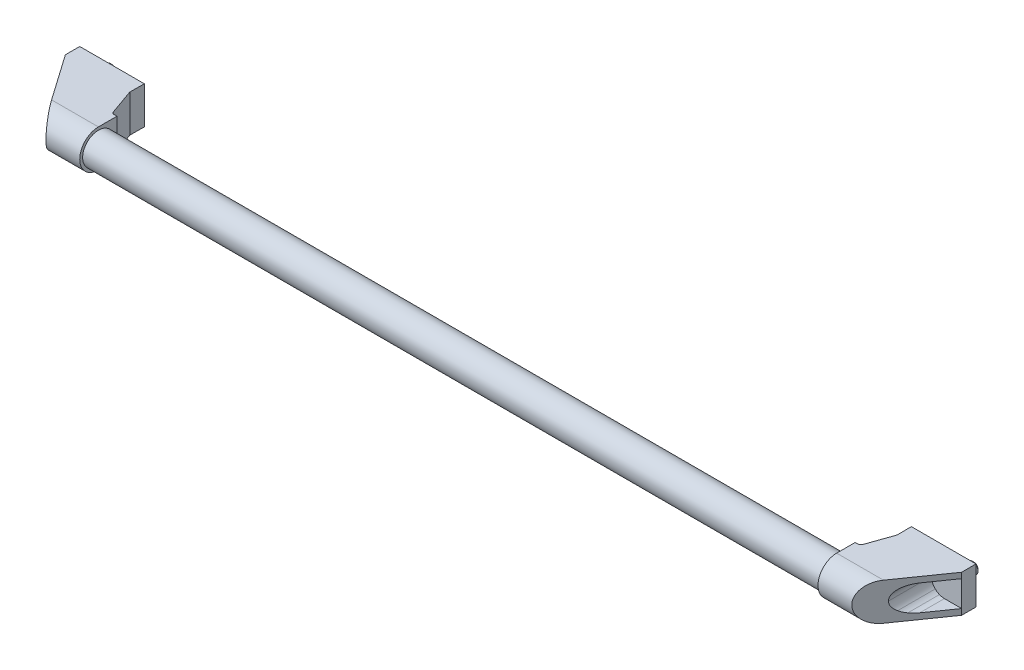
ISO-10303-21;
HEADER;
FILE_DESCRIPTION(('STEP AP214'),'2;1');
FILE_NAME('part.step','',(''),(''),'','','');
FILE_SCHEMA(('AUTOMOTIVE_DESIGN { 1 0 10303 214 1 1 1 1 }'));
ENDSEC;
DATA;
#1=APPLICATION_CONTEXT('core data for automotive mechanical design processes');
#2=APPLICATION_PROTOCOL_DEFINITION('international standard','automotive_design',2000,#1);
#3=PRODUCT_CONTEXT('',#1,'mechanical');
#4=PRODUCT('Part','Part','',(#3));
#5=PRODUCT_RELATED_PRODUCT_CATEGORY('part','',(#4));
#6=PRODUCT_DEFINITION_FORMATION('','',#4);
#7=PRODUCT_DEFINITION_CONTEXT('part definition',#1,'design');
#8=PRODUCT_DEFINITION('design','',#6,#7);
#9=PRODUCT_DEFINITION_SHAPE('','',#8);
#10=(LENGTH_UNIT() NAMED_UNIT(*) SI_UNIT(.MILLI.,.METRE.));
#11=(NAMED_UNIT(*) PLANE_ANGLE_UNIT() SI_UNIT($,.RADIAN.));
#12=(NAMED_UNIT(*) SI_UNIT($,.STERADIAN.) SOLID_ANGLE_UNIT());
#13=UNCERTAINTY_MEASURE_WITH_UNIT(LENGTH_MEASURE(1.E-05),#10,'distance_accuracy_value','');
#14=(GEOMETRIC_REPRESENTATION_CONTEXT(3) GLOBAL_UNCERTAINTY_ASSIGNED_CONTEXT((#13)) GLOBAL_UNIT_ASSIGNED_CONTEXT((#10,
#11,#12)) REPRESENTATION_CONTEXT('',''));
#15=CARTESIAN_POINT('',(0.,0.,0.));
#16=DIRECTION('',(0.,0.,1.));
#17=DIRECTION('',(1.,0.,0.));
#18=AXIS2_PLACEMENT_3D('',#15,#16,#17);
#19=CARTESIAN_POINT('',(612.,13.,-2.41993924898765E-13));
#20=DIRECTION('',(0.,0.,-1.));
#21=DIRECTION('',(-1.,0.,0.));
#22=AXIS2_PLACEMENT_3D('',#19,#20,#21);
#23=PLANE('',#22);
#24=DIRECTION('',(0.,-1.,0.));
#25=VECTOR('',#24,1.);
#26=CARTESIAN_POINT('',(587.,8.,-2.32452945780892E-13));
#27=LINE('',#26,#25);
#28=CARTESIAN_POINT('',(587.,8.,-2.32452945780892E-13));
#29=VERTEX_POINT('',#28);
#30=CARTESIAN_POINT('',(587.,-8.,-2.32452945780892E-13));
#31=VERTEX_POINT('',#30);
#32=EDGE_CURVE('E497',#29,#31,#27,.T.);
#33=ORIENTED_EDGE('',*,*,#32,.F.);
#34=DIRECTION('',(-1.,0.,0.));
#35=VECTOR('',#34,1.);
#36=CARTESIAN_POINT('',(587.,8.,-2.32452945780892E-13));
#37=LINE('',#36,#35);
#38=CARTESIAN_POINT('',(572.,8.,-2.32452945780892E-13));
#39=VERTEX_POINT('',#38);
#40=EDGE_CURVE('E30',#29,#39,#37,.T.);
#41=ORIENTED_EDGE('',*,*,#40,.T.);
#42=DIRECTION('',(0.,1.,0.));
#43=VECTOR('',#42,1.);
#44=CARTESIAN_POINT('',(572.,-8.,-2.32452945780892E-13));
#45=LINE('',#44,#43);
#46=CARTESIAN_POINT('',(572.,-8.,-2.32452945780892E-13));
#47=VERTEX_POINT('',#46);
#48=EDGE_CURVE('E491',#47,#39,#45,.T.);
#49=ORIENTED_EDGE('',*,*,#48,.F.);
#50=DIRECTION('',(1.,0.,0.));
#51=VECTOR('',#50,1.);
#52=CARTESIAN_POINT('',(572.,-8.,-2.32452945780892E-13));
#53=LINE('',#52,#51);
#54=EDGE_CURVE('E494',#47,#31,#53,.T.);
#55=ORIENTED_EDGE('',*,*,#54,.T.);
#56=EDGE_LOOP('',(#33,#41,#49,#55));
#57=FACE_BOUND('',#56,.T.);
#58=DIRECTION('',(0.,1.,0.));
#59=VECTOR('',#58,1.);
#60=CARTESIAN_POINT('',(567.,-13.,-2.23779328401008E-13));
#61=LINE('',#60,#59);
#62=CARTESIAN_POINT('',(567.,-13.,-2.23779328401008E-13));
#63=VERTEX_POINT('',#62);
#64=CARTESIAN_POINT('',(567.,13.,-2.23779328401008E-13));
#65=VERTEX_POINT('',#64);
#66=EDGE_CURVE('E595',#63,#65,#61,.T.);
#67=ORIENTED_EDGE('',*,*,#66,.T.);
#68=DIRECTION('',(-1.,0.,0.));
#69=VECTOR('',#68,1.);
#70=CARTESIAN_POINT('',(612.,13.,-2.41993924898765E-13));
#71=LINE('',#70,#69);
#72=CARTESIAN_POINT('',(612.,13.,-2.41993924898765E-13));
#73=VERTEX_POINT('',#72);
#74=EDGE_CURVE('E626',#73,#65,#71,.T.);
#75=ORIENTED_EDGE('',*,*,#74,.F.);
#76=DIRECTION('',(0.,-1.,0.));
#77=VECTOR('',#76,1.);
#78=CARTESIAN_POINT('',(612.,13.,-2.41993924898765E-13));
#79=LINE('',#78,#77);
#80=CARTESIAN_POINT('',(612.,-13.,-2.41993924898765E-13));
#81=VERTEX_POINT('',#80);
#82=EDGE_CURVE('E621',#73,#81,#79,.T.);
#83=ORIENTED_EDGE('',*,*,#82,.T.);
#84=DIRECTION('',(-1.,0.,0.));
#85=VECTOR('',#84,1.);
#86=CARTESIAN_POINT('',(612.,-13.,-2.41993924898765E-13));
#87=LINE('',#86,#85);
#88=EDGE_CURVE('E629',#81,#63,#87,.T.);
#89=ORIENTED_EDGE('',*,*,#88,.T.);
#90=EDGE_LOOP('',(#67,#75,#83,#89));
#91=FACE_BOUND('',#90,.T.);
#92=CARTESIAN_POINT('',(600.,0.,-2.27248775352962E-13));
#93=DIRECTION('',(0.,0.,1.));
#94=DIRECTION('',(1.,0.,0.));
#95=AXIS2_PLACEMENT_3D('',#92,#93,#94);
#96=CIRCLE('',#95,4.);
#97=CARTESIAN_POINT('',(604.,0.,-2.28671248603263E-13));
#98=VERTEX_POINT('',#97);
#99=EDGE_CURVE('E481',#98,#98,#96,.T.);
#100=ORIENTED_EDGE('',*,*,#99,.T.);
#101=EDGE_LOOP('',(#100));
#102=FACE_BOUND('',#101,.T.);
#103=ADVANCED_FACE('F14',(#57,#91,#102),#23,.T.);
#104=CARTESIAN_POINT('',(612.,-13.,9.99999999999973));
#105=DIRECTION('',(-0.819152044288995,0.,-0.573576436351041));
#106=DIRECTION('',(-0.573576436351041,0.,0.819152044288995));
#107=AXIS2_PLACEMENT_3D('',#104,#105,#106);
#108=PLANE('',#107);
#109=DIRECTION('',(0.573576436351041,0.,-0.819152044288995));
#110=VECTOR('',#109,1.);
#111=CARTESIAN_POINT('',(612.,-8.90119415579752,9.99999999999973));
#112=LINE('',#111,#110);
#113=CARTESIAN_POINT('',(599.999992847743,-8.90119415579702,27.1377862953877));
#114=VERTEX_POINT('',#113);
#115=CARTESIAN_POINT('',(612.,-8.90119415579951,9.99999999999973));
#116=VERTEX_POINT('',#115);
#117=EDGE_CURVE('E9',#114,#116,#112,.T.);
#118=ORIENTED_EDGE('',*,*,#117,.F.);
#119=CARTESIAN_POINT('',(599.999999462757,0.0988421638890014,27.1377768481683));
#120=DIRECTION('',(-0.819152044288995,0.,-0.573576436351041));
#121=DIRECTION('',(-0.573576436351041,0.,0.819152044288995));
#122=AXIS2_PLACEMENT_3D('',#119,#120,#121);
#123=ELLIPSE('',#122,15.6910844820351,9.00003631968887);
#124=CARTESIAN_POINT('',(596.555841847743,-8.21611015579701,32.0565436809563));
#125=VERTEX_POINT('',#124);
#126=EDGE_CURVE('E23',#114,#125,#123,.T.);
#127=ORIENTED_EDGE('',*,*,#126,.T.);
#128=CARTESIAN_POINT('',(600.000013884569,0.0988360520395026,27.1377562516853));
#129=DIRECTION('',(-0.819152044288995,0.,-0.573576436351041));
#130=DIRECTION('',(-0.573576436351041,0.,0.819152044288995));
#131=AXIS2_PLACEMENT_3D('',#128,#129,#130);
#132=ELLIPSE('',#131,15.6910842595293,9.00003619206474);
#133=CARTESIAN_POINT('',(593.636031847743,-6.26515515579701,36.2264645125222));
#134=VERTEX_POINT('',#133);
#135=EDGE_CURVE('E651',#125,#134,#132,.T.);
#136=ORIENTED_EDGE('',*,*,#135,.T.);
#137=CARTESIAN_POINT('',(600.000032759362,0.0988180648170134,27.1377292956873));
#138=DIRECTION('',(-0.819152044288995,0.,-0.573576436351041));
#139=DIRECTION('',(-0.573576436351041,0.,0.819152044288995));
#140=AXIS2_PLACEMENT_3D('',#137,#138,#139);
#141=ELLIPSE('',#140,15.6910853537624,9.00003681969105);
#142=CARTESIAN_POINT('',(590.999995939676,0.0988089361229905,39.9911139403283));
#143=VERTEX_POINT('',#142);
#144=EDGE_CURVE('E648',#134,#143,#141,.T.);
#145=ORIENTED_EDGE('',*,*,#144,.T.);
#146=CARTESIAN_POINT('',(600.000030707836,0.098790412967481,27.1377322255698));
#147=DIRECTION('',(-0.819152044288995,0.,-0.573576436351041));
#148=DIRECTION('',(-0.573576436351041,0.,0.819152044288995));
#149=AXIS2_PLACEMENT_3D('',#146,#147,#148);
#150=ELLIPSE('',#149,15.6910817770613,9.00003476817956);
#151=CARTESIAN_POINT('',(593.636039,6.4627699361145,36.2264542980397));
#152=VERTEX_POINT('',#151);
#153=EDGE_CURVE('E645',#143,#152,#150,.T.);
#154=ORIENTED_EDGE('',*,*,#153,.T.);
#155=CARTESIAN_POINT('',(600.000021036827,0.0987787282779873,27.1377460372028));
#156=DIRECTION('',(-0.819152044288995,0.,-0.573576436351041));
#157=DIRECTION('',(-0.573576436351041,0.,0.819152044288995));
#158=AXIS2_PLACEMENT_3D('',#155,#156,#157);
#159=ELLIPSE('',#158,15.6910842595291,9.00003619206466);
#160=CARTESIAN_POINT('',(596.555849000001,8.4137249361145,32.0565334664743));
#161=VERTEX_POINT('',#160);
#162=EDGE_CURVE('E642',#152,#161,#159,.T.);
#163=ORIENTED_EDGE('',*,*,#162,.T.);
#164=CARTESIAN_POINT('',(600.000006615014,0.098772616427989,27.1377666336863));
#165=DIRECTION('',(-0.819152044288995,0.,-0.573576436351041));
#166=DIRECTION('',(-0.573576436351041,0.,0.819152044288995));
#167=AXIS2_PLACEMENT_3D('',#164,#165,#166);
#168=ELLIPSE('',#167,15.691084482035,9.0000363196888);
#169=CARTESIAN_POINT('',(600.,9.09880893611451,27.1377760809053));
#170=VERTEX_POINT('',#169);
#171=EDGE_CURVE('E639',#161,#170,#168,.T.);
#172=ORIENTED_EDGE('',*,*,#171,.T.);
#173=DIRECTION('',(0.573576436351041,0.,-0.819152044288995));
#174=VECTOR('',#173,1.);
#175=CARTESIAN_POINT('',(612.,9.09880893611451,9.99999999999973));
#176=LINE('',#175,#174);
#177=CARTESIAN_POINT('',(612.,9.09880893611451,9.99999999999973));
#178=VERTEX_POINT('',#177);
#179=EDGE_CURVE('E636',#170,#178,#176,.T.);
#180=ORIENTED_EDGE('',*,*,#179,.T.);
#181=DIRECTION('',(0.,1.,0.));
#182=VECTOR('',#181,1.);
#183=CARTESIAN_POINT('',(612.,-13.,9.99999999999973));
#184=LINE('',#183,#182);
#185=CARTESIAN_POINT('',(612.,13.,9.99999999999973));
#186=VERTEX_POINT('',#185);
#187=EDGE_CURVE('E604',#178,#186,#184,.T.);
#188=ORIENTED_EDGE('',*,*,#187,.T.);
#189=DIRECTION('',(-0.573576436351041,0.,0.819152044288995));
#190=VECTOR('',#189,1.);
#191=CARTESIAN_POINT('',(612.,13.,9.99999999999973));
#192=LINE('',#191,#190);
#193=CARTESIAN_POINT('',(589.59335877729,13.,42.));
#194=VERTEX_POINT('',#193);
#195=EDGE_CURVE('E598',#186,#194,#192,.T.);
#196=ORIENTED_EDGE('',*,*,#195,.T.);
#197=CARTESIAN_POINT('',(589.59335877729,0.,42.));
#198=DIRECTION('',(-0.819152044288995,0.,-0.573576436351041));
#199=DIRECTION('',(-0.573576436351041,0.,0.819152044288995));
#200=AXIS2_PLACEMENT_3D('',#197,#198,#199);
#201=ELLIPSE('',#200,15.8700696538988,13.);
#202=CARTESIAN_POINT('',(589.59335877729,-13.,42.));
#203=VERTEX_POINT('',#202);
#204=EDGE_CURVE('E608',#203,#194,#201,.T.);
#205=ORIENTED_EDGE('',*,*,#204,.F.);
#206=DIRECTION('',(-0.573576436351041,0.,0.819152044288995));
#207=VECTOR('',#206,1.);
#208=CARTESIAN_POINT('',(612.,-13.,9.99999999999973));
#209=LINE('',#208,#207);
#210=CARTESIAN_POINT('',(612.,-13.,9.99999999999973));
#211=VERTEX_POINT('',#210);
#212=EDGE_CURVE('E601',#211,#203,#209,.T.);
#213=ORIENTED_EDGE('',*,*,#212,.F.);
#214=EDGE_CURVE('E605',#211,#116,#184,.T.);
#215=ORIENTED_EDGE('',*,*,#214,.T.);
#216=EDGE_LOOP('',(#118,#127,#136,#145,#154,#163,#172,#180,#188,#196,#205,#213,#215));
#217=FACE_BOUND('',#216,.T.);
#218=ADVANCED_FACE('F657',(#217),#108,.F.);
#219=CARTESIAN_POINT('',(612.,13.,42.));
#220=DIRECTION('',(0.,1.,0.));
#221=DIRECTION('',(-1.,0.,0.));
#222=AXIS2_PLACEMENT_3D('',#219,#220,#221);
#223=PLANE('',#222);
#224=DIRECTION('',(-0.0104830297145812,0.,-0.999945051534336));
#225=VECTOR('',#224,1.);
#226=CARTESIAN_POINT('',(567.104830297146,13.,9.99945051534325));
#227=LINE('',#226,#225);
#228=CARTESIAN_POINT('',(567.104830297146,13.,9.99945051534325));
#229=VERTEX_POINT('',#228);
#230=EDGE_CURVE('E573',#229,#65,#227,.T.);
#231=ORIENTED_EDGE('',*,*,#230,.F.);
#232=DIRECTION('',(-0.332150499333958,0.,0.943226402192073));
#233=VECTOR('',#232,1.);
#234=CARTESIAN_POINT('',(567.104830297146,13.,9.99945051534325));
#235=LINE('',#234,#233);
#236=CARTESIAN_POINT('',(560.854102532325,13.,27.7499927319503));
#237=VERTEX_POINT('',#236);
#238=EDGE_CURVE('E570',#229,#237,#235,.T.);
#239=ORIENTED_EDGE('',*,*,#238,.T.);
#240=CARTESIAN_POINT('',(558.967649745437,13.,27.0856916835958));
#241=DIRECTION('',(0.,1.,0.));
#242=DIRECTION('',(-1.,0.,0.));
#243=AXIS2_PLACEMENT_3D('',#240,#241,#242);
#244=CIRCLE('',#243,2.);
#245=CARTESIAN_POINT('',(558.988615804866,13.,29.0855817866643));
#246=VERTEX_POINT('',#245);
#247=EDGE_CURVE('E567',#246,#237,#244,.T.);
#248=ORIENTED_EDGE('',*,*,#247,.F.);
#249=DIRECTION('',(0.999945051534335,0.,-0.0104830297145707));
#250=VECTOR('',#249,1.);
#251=CARTESIAN_POINT('',(557.,13.,29.1064296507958));
#252=LINE('',#251,#250);
#253=CARTESIAN_POINT('',(557.,13.,29.1064296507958));
#254=VERTEX_POINT('',#253);
#255=EDGE_CURVE('E564',#254,#246,#252,.T.);
#256=ORIENTED_EDGE('',*,*,#255,.F.);
#257=DIRECTION('',(0.,0.,-1.));
#258=VECTOR('',#257,1.);
#259=CARTESIAN_POINT('',(557.,13.,42.));
#260=LINE('',#259,#258);
#261=CARTESIAN_POINT('',(557.,13.,42.));
#262=VERTEX_POINT('',#261);
#263=EDGE_CURVE('E610',#262,#254,#260,.T.);
#264=ORIENTED_EDGE('',*,*,#263,.F.);
#265=DIRECTION('',(-1.,0.,0.));
#266=VECTOR('',#265,1.);
#267=CARTESIAN_POINT('',(612.,13.,42.));
#268=LINE('',#267,#266);
#269=EDGE_CURVE('E634',#194,#262,#268,.T.);
#270=ORIENTED_EDGE('',*,*,#269,.F.);
#271=ORIENTED_EDGE('',*,*,#195,.F.);
#272=DIRECTION('',(0.,0.,-1.));
#273=VECTOR('',#272,1.);
#274=CARTESIAN_POINT('',(612.,13.,42.));
#275=LINE('',#274,#273);
#276=EDGE_CURVE('E619',#186,#73,#275,.T.);
#277=ORIENTED_EDGE('',*,*,#276,.T.);
#278=ORIENTED_EDGE('',*,*,#74,.T.);
#279=EDGE_LOOP('',(#231,#239,#248,#256,#264,#270,#271,#277,#278));
#280=FACE_BOUND('',#279,.T.);
#281=ADVANCED_FACE('F691',(#280),#223,.T.);
#282=CARTESIAN_POINT('',(612.,0.,42.));
#283=DIRECTION('',(-1.,0.,0.));
#284=DIRECTION('',(0.,-1.,0.));
#285=AXIS2_PLACEMENT_3D('',#282,#283,#284);
#286=CYLINDRICAL_SURFACE('',#285,13.);
#287=ORIENTED_EDGE('',*,*,#204,.T.);
#288=ORIENTED_EDGE('',*,*,#269,.T.);
#289=CARTESIAN_POINT('',(557.,0.,42.));
#290=DIRECTION('',(1.,0.,0.));
#291=DIRECTION('',(0.,1.,0.));
#292=AXIS2_PLACEMENT_3D('',#289,#290,#291);
#293=CIRCLE('',#292,13.);
#294=CARTESIAN_POINT('',(557.,-13.,42.));
#295=VERTEX_POINT('',#294);
#296=EDGE_CURVE('E616',#262,#295,#293,.T.);
#297=ORIENTED_EDGE('',*,*,#296,.T.);
#298=DIRECTION('',(-1.,0.,0.));
#299=VECTOR('',#298,1.);
#300=CARTESIAN_POINT('',(612.,-13.,42.));
#301=LINE('',#300,#299);
#302=EDGE_CURVE('E632',#203,#295,#301,.T.);
#303=ORIENTED_EDGE('',*,*,#302,.F.);
#304=EDGE_LOOP('',(#287,#288,#297,#303));
#305=FACE_BOUND('',#304,.T.);
#306=ADVANCED_FACE('F16',(#305),#286,.T.);
#307=CARTESIAN_POINT('',(612.,-13.,42.));
#308=DIRECTION('',(0.,1.,0.));
#309=DIRECTION('',(-1.,0.,0.));
#310=AXIS2_PLACEMENT_3D('',#307,#308,#309);
#311=PLANE('',#310);
#312=DIRECTION('',(-0.332150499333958,0.,0.943226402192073));
#313=VECTOR('',#312,1.);
#314=CARTESIAN_POINT('',(567.104830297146,-13.,9.99945051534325));
#315=LINE('',#314,#313);
#316=CARTESIAN_POINT('',(567.104830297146,-13.,9.99945051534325));
#317=VERTEX_POINT('',#316);
#318=CARTESIAN_POINT('',(560.854102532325,-13.,27.7499927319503));
#319=VERTEX_POINT('',#318);
#320=EDGE_CURVE('E581',#317,#319,#315,.T.);
#321=ORIENTED_EDGE('',*,*,#320,.F.);
#322=DIRECTION('',(-0.0104830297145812,0.,-0.999945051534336));
#323=VECTOR('',#322,1.);
#324=CARTESIAN_POINT('',(567.104830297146,-13.,9.99945051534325));
#325=LINE('',#324,#323);
#326=EDGE_CURVE('E584',#317,#63,#325,.T.);
#327=ORIENTED_EDGE('',*,*,#326,.T.);
#328=ORIENTED_EDGE('',*,*,#88,.F.);
#329=DIRECTION('',(0.,0.,-1.));
#330=VECTOR('',#329,1.);
#331=CARTESIAN_POINT('',(612.,-13.,42.));
#332=LINE('',#331,#330);
#333=EDGE_CURVE('E624',#211,#81,#332,.T.);
#334=ORIENTED_EDGE('',*,*,#333,.F.);
#335=ORIENTED_EDGE('',*,*,#212,.T.);
#336=ORIENTED_EDGE('',*,*,#302,.T.);
#337=DIRECTION('',(0.,0.,-1.));
#338=VECTOR('',#337,1.);
#339=CARTESIAN_POINT('',(557.,-13.,42.));
#340=LINE('',#339,#338);
#341=CARTESIAN_POINT('',(557.,-13.,29.1064296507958));
#342=VERTEX_POINT('',#341);
#343=EDGE_CURVE('E613',#295,#342,#340,.T.);
#344=ORIENTED_EDGE('',*,*,#343,.T.);
#345=DIRECTION('',(0.999945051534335,0.,-0.0104830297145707));
#346=VECTOR('',#345,1.);
#347=CARTESIAN_POINT('',(557.,-13.,29.1064296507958));
#348=LINE('',#347,#346);
#349=CARTESIAN_POINT('',(558.988615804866,-13.,29.0855817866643));
#350=VERTEX_POINT('',#349);
#351=EDGE_CURVE('E575',#342,#350,#348,.T.);
#352=ORIENTED_EDGE('',*,*,#351,.T.);
#353=CARTESIAN_POINT('',(558.967649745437,-13.,27.0856916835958));
#354=DIRECTION('',(0.,1.,0.));
#355=DIRECTION('',(-1.,0.,0.));
#356=AXIS2_PLACEMENT_3D('',#353,#354,#355);
#357=CIRCLE('',#356,2.);
#358=EDGE_CURVE('E578',#350,#319,#357,.T.);
#359=ORIENTED_EDGE('',*,*,#358,.T.);
#360=EDGE_LOOP('',(#321,#327,#328,#334,#335,#336,#344,#352,#359));
#361=FACE_BOUND('',#360,.T.);
#362=ADVANCED_FACE('F701',(#361),#311,.F.);
#363=CARTESIAN_POINT('',(612.,0.,42.));
#364=DIRECTION('',(1.,0.,0.));
#365=DIRECTION('',(0.,1.,0.));
#366=AXIS2_PLACEMENT_3D('',#363,#364,#365);
#367=PLANE('',#366);
#368=ORIENTED_EDGE('',*,*,#214,.F.);
#369=ORIENTED_EDGE('',*,*,#333,.T.);
#370=ORIENTED_EDGE('',*,*,#82,.F.);
#371=ORIENTED_EDGE('',*,*,#276,.F.);
#372=ORIENTED_EDGE('',*,*,#187,.F.);
#373=DIRECTION('',(0.,1.,0.));
#374=VECTOR('',#373,1.);
#375=CARTESIAN_POINT('',(612.,-8.90119415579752,9.99999999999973));
#376=LINE('',#375,#374);
#377=EDGE_CURVE('E541',#116,#178,#376,.T.);
#378=ORIENTED_EDGE('',*,*,#377,.F.);
#379=EDGE_LOOP('',(#368,#369,#370,#371,#372,#378));
#380=FACE_BOUND('',#379,.T.);
#381=ADVANCED_FACE('F686',(#380),#367,.T.);
#382=CARTESIAN_POINT('',(557.,0.,42.));
#383=DIRECTION('',(1.,0.,0.));
#384=DIRECTION('',(0.,1.,0.));
#385=AXIS2_PLACEMENT_3D('',#382,#383,#384);
#386=PLANE('',#385);
#387=CARTESIAN_POINT('',(557.,0.,42.));
#388=DIRECTION('',(1.,0.,0.));
#389=DIRECTION('',(0.,1.,0.));
#390=AXIS2_PLACEMENT_3D('',#387,#388,#389);
#391=CIRCLE('',#390,11.);
#392=CARTESIAN_POINT('',(557.,11.,42.));
#393=VERTEX_POINT('',#392);
#394=EDGE_CURVE('E18',#393,#393,#391,.T.);
#395=ORIENTED_EDGE('',*,*,#394,.T.);
#396=EDGE_LOOP('',(#395));
#397=FACE_BOUND('',#396,.T.);
#398=ORIENTED_EDGE('',*,*,#263,.T.);
#399=DIRECTION('',(0.,1.,0.));
#400=VECTOR('',#399,1.);
#401=CARTESIAN_POINT('',(557.,-13.,29.1064296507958));
#402=LINE('',#401,#400);
#403=EDGE_CURVE('E587',#342,#254,#402,.T.);
#404=ORIENTED_EDGE('',*,*,#403,.F.);
#405=ORIENTED_EDGE('',*,*,#343,.F.);
#406=ORIENTED_EDGE('',*,*,#296,.F.);
#407=EDGE_LOOP('',(#398,#404,#405,#406));
#408=FACE_BOUND('',#407,.T.);
#409=ADVANCED_FACE('F717',(#397,#408),#386,.F.);
#410=CARTESIAN_POINT('',(567.104830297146,-13.,9.99945051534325));
#411=DIRECTION('',(0.999945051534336,0.,-0.0104830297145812));
#412=DIRECTION('',(-0.0104830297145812,0.,-0.999945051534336));
#413=AXIS2_PLACEMENT_3D('',#410,#411,#412);
#414=PLANE('',#413);
#415=DIRECTION('',(0.,1.,0.));
#416=VECTOR('',#415,1.);
#417=CARTESIAN_POINT('',(567.104830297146,-13.,9.99945051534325));
#418=LINE('',#417,#416);
#419=EDGE_CURVE('E593',#317,#229,#418,.T.);
#420=ORIENTED_EDGE('',*,*,#419,.T.);
#421=ORIENTED_EDGE('',*,*,#230,.T.);
#422=ORIENTED_EDGE('',*,*,#66,.F.);
#423=ORIENTED_EDGE('',*,*,#326,.F.);
#424=EDGE_LOOP('',(#420,#421,#422,#423));
#425=FACE_BOUND('',#424,.T.);
#426=ADVANCED_FACE('F698',(#425),#414,.F.);
#427=CARTESIAN_POINT('',(567.104830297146,-13.,9.99945051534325));
#428=DIRECTION('',(-0.943226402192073,0.,-0.332150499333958));
#429=DIRECTION('',(-0.332150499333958,0.,0.943226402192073));
#430=AXIS2_PLACEMENT_3D('',#427,#428,#429);
#431=PLANE('',#430);
#432=DIRECTION('',(0.,1.,0.));
#433=VECTOR('',#432,1.);
#434=CARTESIAN_POINT('',(560.854102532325,-13.,27.7499927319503));
#435=LINE('',#434,#433);
#436=EDGE_CURVE('E591',#319,#237,#435,.T.);
#437=ORIENTED_EDGE('',*,*,#436,.T.);
#438=ORIENTED_EDGE('',*,*,#238,.F.);
#439=ORIENTED_EDGE('',*,*,#419,.F.);
#440=ORIENTED_EDGE('',*,*,#320,.T.);
#441=EDGE_LOOP('',(#437,#438,#439,#440));
#442=FACE_BOUND('',#441,.T.);
#443=ADVANCED_FACE('F705',(#442),#431,.T.);
#444=CARTESIAN_POINT('',(558.967649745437,-13.,27.0856916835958));
#445=DIRECTION('',(0.,1.,0.));
#446=DIRECTION('',(-1.,0.,0.));
#447=AXIS2_PLACEMENT_3D('',#444,#445,#446);
#448=CYLINDRICAL_SURFACE('',#447,2.);
#449=DIRECTION('',(0.,1.,0.));
#450=VECTOR('',#449,1.);
#451=CARTESIAN_POINT('',(558.988615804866,-13.,29.0855817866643));
#452=LINE('',#451,#450);
#453=EDGE_CURVE('E589',#350,#246,#452,.T.);
#454=ORIENTED_EDGE('',*,*,#453,.T.);
#455=ORIENTED_EDGE('',*,*,#247,.T.);
#456=ORIENTED_EDGE('',*,*,#436,.F.);
#457=ORIENTED_EDGE('',*,*,#358,.F.);
#458=EDGE_LOOP('',(#454,#455,#456,#457));
#459=FACE_BOUND('',#458,.T.);
#460=ADVANCED_FACE('F711',(#459),#448,.F.);
#461=CARTESIAN_POINT('',(557.,-13.,29.1064296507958));
#462=DIRECTION('',(0.0104830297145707,0.,0.999945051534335));
#463=DIRECTION('',(0.999945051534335,0.,-0.0104830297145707));
#464=AXIS2_PLACEMENT_3D('',#461,#462,#463);
#465=PLANE('',#464);
#466=ORIENTED_EDGE('',*,*,#403,.T.);
#467=ORIENTED_EDGE('',*,*,#255,.T.);
#468=ORIENTED_EDGE('',*,*,#453,.F.);
#469=ORIENTED_EDGE('',*,*,#351,.F.);
#470=EDGE_LOOP('',(#466,#467,#468,#469));
#471=FACE_BOUND('',#470,.T.);
#472=ADVANCED_FACE('F713',(#471),#465,.F.);
#473=CARTESIAN_POINT('',(612.,-8.90119415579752,9.99999999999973));
#474=DIRECTION('',(0.,1.,0.));
#475=DIRECTION('',(-1.,0.,0.));
#476=AXIS2_PLACEMENT_3D('',#473,#474,#475);
#477=PLANE('',#476);
#478=ORIENTED_EDGE('',*,*,#117,.T.);
#479=DIRECTION('',(-1.,0.,0.));
#480=VECTOR('',#479,1.);
#481=CARTESIAN_POINT('',(612.,-8.90119415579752,9.99999999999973));
#482=LINE('',#481,#480);
#483=CARTESIAN_POINT('',(599.999992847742,-8.90119415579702,9.99999999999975));
#484=VERTEX_POINT('',#483);
#485=EDGE_CURVE('E38',#116,#484,#482,.T.);
#486=ORIENTED_EDGE('',*,*,#485,.T.);
#487=DIRECTION('',(0.,0.,1.));
#488=VECTOR('',#487,1.);
#489=CARTESIAN_POINT('',(599.999992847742,-8.90119415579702,9.99999999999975));
#490=LINE('',#489,#488);
#491=EDGE_CURVE('E561',#484,#114,#490,.T.);
#492=ORIENTED_EDGE('',*,*,#491,.T.);
#493=EDGE_LOOP('',(#478,#486,#492));
#494=FACE_BOUND('',#493,.T.);
#495=ADVANCED_FACE('F662',(#494),#477,.T.);
#496=CARTESIAN_POINT('',(599.999999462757,0.0988421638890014,9.99999999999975));
#497=DIRECTION('',(0.,0.,1.));
#498=DIRECTION('',(1.,0.,0.));
#499=AXIS2_PLACEMENT_3D('',#496,#497,#498);
#500=CYLINDRICAL_SURFACE('',#499,9.00003631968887);
#501=ORIENTED_EDGE('',*,*,#491,.F.);
#502=CARTESIAN_POINT('',(599.999999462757,0.0988421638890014,9.99999999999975));
#503=DIRECTION('',(0.,0.,1.));
#504=DIRECTION('',(1.,0.,0.));
#505=AXIS2_PLACEMENT_3D('',#502,#503,#504);
#506=CIRCLE('',#505,9.00003631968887);
#507=CARTESIAN_POINT('',(596.555841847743,-8.21611015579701,9.99999999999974));
#508=VERTEX_POINT('',#507);
#509=EDGE_CURVE('E521',#508,#484,#506,.T.);
#510=ORIENTED_EDGE('',*,*,#509,.F.);
#511=DIRECTION('',(0.,0.,1.));
#512=VECTOR('',#511,1.);
#513=CARTESIAN_POINT('',(596.555841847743,-8.21611015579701,9.99999999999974));
#514=LINE('',#513,#512);
#515=EDGE_CURVE('E558',#508,#125,#514,.T.);
#516=ORIENTED_EDGE('',*,*,#515,.T.);
#517=ORIENTED_EDGE('',*,*,#126,.F.);
#518=EDGE_LOOP('',(#501,#510,#516,#517));
#519=FACE_BOUND('',#518,.T.);
#520=ADVANCED_FACE('F659',(#519),#500,.F.);
#521=CARTESIAN_POINT('',(600.000013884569,0.0988360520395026,9.99999999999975));
#522=DIRECTION('',(0.,0.,1.));
#523=DIRECTION('',(1.,0.,0.));
#524=AXIS2_PLACEMENT_3D('',#521,#522,#523);
#525=CYLINDRICAL_SURFACE('',#524,9.00003619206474);
#526=ORIENTED_EDGE('',*,*,#515,.F.);
#527=CARTESIAN_POINT('',(600.000013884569,0.0988360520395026,9.99999999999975));
#528=DIRECTION('',(0.,0.,1.));
#529=DIRECTION('',(1.,0.,0.));
#530=AXIS2_PLACEMENT_3D('',#527,#528,#529);
#531=CIRCLE('',#530,9.00003619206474);
#532=CARTESIAN_POINT('',(593.636031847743,-6.26515515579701,9.99999999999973));
#533=VERTEX_POINT('',#532);
#534=EDGE_CURVE('E523',#533,#508,#531,.T.);
#535=ORIENTED_EDGE('',*,*,#534,.F.);
#536=DIRECTION('',(0.,0.,1.));
#537=VECTOR('',#536,1.);
#538=CARTESIAN_POINT('',(593.636031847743,-6.26515515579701,9.99999999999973));
#539=LINE('',#538,#537);
#540=EDGE_CURVE('E555',#533,#134,#539,.T.);
#541=ORIENTED_EDGE('',*,*,#540,.T.);
#542=ORIENTED_EDGE('',*,*,#135,.F.);
#543=EDGE_LOOP('',(#526,#535,#541,#542));
#544=FACE_BOUND('',#543,.T.);
#545=ADVANCED_FACE('F667',(#544),#525,.F.);
#546=CARTESIAN_POINT('',(600.000032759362,0.0988180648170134,9.99999999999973));
#547=DIRECTION('',(0.,0.,1.));
#548=DIRECTION('',(1.,0.,0.));
#549=AXIS2_PLACEMENT_3D('',#546,#547,#548);
#550=CYLINDRICAL_SURFACE('',#549,9.00003681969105);
#551=ORIENTED_EDGE('',*,*,#540,.F.);
#552=CARTESIAN_POINT('',(600.000032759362,0.0988180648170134,9.99999999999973));
#553=DIRECTION('',(0.,0.,1.));
#554=DIRECTION('',(1.,0.,0.));
#555=AXIS2_PLACEMENT_3D('',#552,#553,#554);
#556=CIRCLE('',#555,9.00003681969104);
#557=CARTESIAN_POINT('',(590.999995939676,0.0988089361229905,9.99999999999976));
#558=VERTEX_POINT('',#557);
#559=EDGE_CURVE('E526',#558,#533,#556,.T.);
#560=ORIENTED_EDGE('',*,*,#559,.F.);
#561=DIRECTION('',(0.,0.,1.));
#562=VECTOR('',#561,1.);
#563=CARTESIAN_POINT('',(590.999995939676,0.0988089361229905,9.99999999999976));
#564=LINE('',#563,#562);
#565=EDGE_CURVE('E552',#558,#143,#564,.T.);
#566=ORIENTED_EDGE('',*,*,#565,.T.);
#567=ORIENTED_EDGE('',*,*,#144,.F.);
#568=EDGE_LOOP('',(#551,#560,#566,#567));
#569=FACE_BOUND('',#568,.T.);
#570=ADVANCED_FACE('F669',(#569),#550,.F.);
#571=CARTESIAN_POINT('',(600.000030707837,0.098790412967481,9.99999999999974));
#572=DIRECTION('',(0.,0.,1.));
#573=DIRECTION('',(1.,0.,0.));
#574=AXIS2_PLACEMENT_3D('',#571,#572,#573);
#575=CYLINDRICAL_SURFACE('',#574,9.00003476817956);
#576=ORIENTED_EDGE('',*,*,#565,.F.);
#577=CARTESIAN_POINT('',(600.000030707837,0.098790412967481,9.99999999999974));
#578=DIRECTION('',(0.,0.,1.));
#579=DIRECTION('',(1.,0.,0.));
#580=AXIS2_PLACEMENT_3D('',#577,#578,#579);
#581=CIRCLE('',#580,9.00003476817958);
#582=CARTESIAN_POINT('',(593.636039,6.4627699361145,9.99999999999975));
#583=VERTEX_POINT('',#582);
#584=EDGE_CURVE('E529',#583,#558,#581,.T.);
#585=ORIENTED_EDGE('',*,*,#584,.F.);
#586=DIRECTION('',(0.,0.,1.));
#587=VECTOR('',#586,1.);
#588=CARTESIAN_POINT('',(593.636039,6.4627699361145,9.99999999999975));
#589=LINE('',#588,#587);
#590=EDGE_CURVE('E549',#583,#152,#589,.T.);
#591=ORIENTED_EDGE('',*,*,#590,.T.);
#592=ORIENTED_EDGE('',*,*,#153,.F.);
#593=EDGE_LOOP('',(#576,#585,#591,#592));
#594=FACE_BOUND('',#593,.T.);
#595=ADVANCED_FACE('F672',(#594),#575,.F.);
#596=CARTESIAN_POINT('',(600.000021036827,0.0987787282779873,9.99999999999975));
#597=DIRECTION('',(0.,0.,1.));
#598=DIRECTION('',(1.,0.,0.));
#599=AXIS2_PLACEMENT_3D('',#596,#597,#598);
#600=CYLINDRICAL_SURFACE('',#599,9.00003619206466);
#601=ORIENTED_EDGE('',*,*,#590,.F.);
#602=CARTESIAN_POINT('',(600.000021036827,0.0987787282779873,9.99999999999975));
#603=DIRECTION('',(0.,0.,1.));
#604=DIRECTION('',(1.,0.,0.));
#605=AXIS2_PLACEMENT_3D('',#602,#603,#604);
#606=CIRCLE('',#605,9.00003619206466);
#607=CARTESIAN_POINT('',(596.555849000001,8.4137249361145,9.99999999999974));
#608=VERTEX_POINT('',#607);
#609=EDGE_CURVE('E532',#608,#583,#606,.T.);
#610=ORIENTED_EDGE('',*,*,#609,.F.);
#611=DIRECTION('',(0.,0.,1.));
#612=VECTOR('',#611,1.);
#613=CARTESIAN_POINT('',(596.555849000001,8.4137249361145,9.99999999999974));
#614=LINE('',#613,#612);
#615=EDGE_CURVE('E546',#608,#161,#614,.T.);
#616=ORIENTED_EDGE('',*,*,#615,.T.);
#617=ORIENTED_EDGE('',*,*,#162,.F.);
#618=EDGE_LOOP('',(#601,#610,#616,#617));
#619=FACE_BOUND('',#618,.T.);
#620=ADVANCED_FACE('F676',(#619),#600,.F.);
#621=CARTESIAN_POINT('',(600.000006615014,0.098772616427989,9.99999999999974));
#622=DIRECTION('',(0.,0.,1.));
#623=DIRECTION('',(1.,0.,0.));
#624=AXIS2_PLACEMENT_3D('',#621,#622,#623);
#625=CYLINDRICAL_SURFACE('',#624,9.0000363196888);
#626=ORIENTED_EDGE('',*,*,#615,.F.);
#627=CARTESIAN_POINT('',(600.000006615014,0.098772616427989,9.99999999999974));
#628=DIRECTION('',(0.,0.,1.));
#629=DIRECTION('',(1.,0.,0.));
#630=AXIS2_PLACEMENT_3D('',#627,#628,#629);
#631=CIRCLE('',#630,9.0000363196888);
#632=CARTESIAN_POINT('',(600.,9.09880893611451,9.99999999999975));
#633=VERTEX_POINT('',#632);
#634=EDGE_CURVE('E535',#633,#608,#631,.T.);
#635=ORIENTED_EDGE('',*,*,#634,.F.);
#636=DIRECTION('',(0.,0.,1.));
#637=VECTOR('',#636,1.);
#638=CARTESIAN_POINT('',(600.,9.09880893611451,9.99999999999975));
#639=LINE('',#638,#637);
#640=EDGE_CURVE('E543',#633,#170,#639,.T.);
#641=ORIENTED_EDGE('',*,*,#640,.T.);
#642=ORIENTED_EDGE('',*,*,#171,.F.);
#643=EDGE_LOOP('',(#626,#635,#641,#642));
#644=FACE_BOUND('',#643,.T.);
#645=ADVANCED_FACE('F679',(#644),#625,.F.);
#646=CARTESIAN_POINT('',(612.,9.09880893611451,9.99999999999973));
#647=DIRECTION('',(0.,1.,0.));
#648=DIRECTION('',(-1.,0.,0.));
#649=AXIS2_PLACEMENT_3D('',#646,#647,#648);
#650=PLANE('',#649);
#651=ORIENTED_EDGE('',*,*,#640,.F.);
#652=DIRECTION('',(-1.,0.,0.));
#653=VECTOR('',#652,1.);
#654=CARTESIAN_POINT('',(612.,9.09880893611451,9.99999999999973));
#655=LINE('',#654,#653);
#656=EDGE_CURVE('E538',#178,#633,#655,.T.);
#657=ORIENTED_EDGE('',*,*,#656,.F.);
#658=ORIENTED_EDGE('',*,*,#179,.F.);
#659=EDGE_LOOP('',(#651,#657,#658));
#660=FACE_BOUND('',#659,.T.);
#661=ADVANCED_FACE('F764',(#660),#650,.F.);
#662=CARTESIAN_POINT('',(599.999999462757,0.0988421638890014,9.99999999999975));
#663=DIRECTION('',(0.,0.,1.));
#664=DIRECTION('',(1.,0.,0.));
#665=AXIS2_PLACEMENT_3D('',#662,#663,#664);
#666=PLANE('',#665);
#667=ORIENTED_EDGE('',*,*,#485,.F.);
#668=ORIENTED_EDGE('',*,*,#377,.T.);
#669=ORIENTED_EDGE('',*,*,#656,.T.);
#670=ORIENTED_EDGE('',*,*,#634,.T.);
#671=ORIENTED_EDGE('',*,*,#609,.T.);
#672=ORIENTED_EDGE('',*,*,#584,.T.);
#673=ORIENTED_EDGE('',*,*,#559,.T.);
#674=ORIENTED_EDGE('',*,*,#534,.T.);
#675=ORIENTED_EDGE('',*,*,#509,.T.);
#676=EDGE_LOOP('',(#667,#668,#669,#670,#671,#672,#673,#674,#675));
#677=FACE_BOUND('',#676,.T.);
#678=ADVANCED_FACE('F664',(#677),#666,.T.);
#679=CARTESIAN_POINT('',(587.,8.,30.));
#680=DIRECTION('',(0.,-1.,0.));
#681=DIRECTION('',(1.,0.,0.));
#682=AXIS2_PLACEMENT_3D('',#679,#680,#681);
#683=PLANE('',#682);
#684=DIRECTION('',(0.,0.,-1.));
#685=VECTOR('',#684,1.);
#686=CARTESIAN_POINT('',(572.,8.,30.));
#687=LINE('',#686,#685);
#688=CARTESIAN_POINT('',(572.,8.,30.));
#689=VERTEX_POINT('',#688);
#690=EDGE_CURVE('E518',#689,#39,#687,.T.);
#691=ORIENTED_EDGE('',*,*,#690,.T.);
#692=ORIENTED_EDGE('',*,*,#40,.F.);
#693=DIRECTION('',(0.,0.,-1.));
#694=VECTOR('',#693,1.);
#695=CARTESIAN_POINT('',(587.,8.,30.));
#696=LINE('',#695,#694);
#697=CARTESIAN_POINT('',(587.,8.,30.));
#698=VERTEX_POINT('',#697);
#699=EDGE_CURVE('E512',#698,#29,#696,.T.);
#700=ORIENTED_EDGE('',*,*,#699,.F.);
#701=DIRECTION('',(-1.,0.,0.));
#702=VECTOR('',#701,1.);
#703=CARTESIAN_POINT('',(587.,8.,30.));
#704=LINE('',#703,#702);
#705=EDGE_CURVE('E500',#698,#689,#704,.T.);
#706=ORIENTED_EDGE('',*,*,#705,.T.);
#707=EDGE_LOOP('',(#691,#692,#700,#706));
#708=FACE_BOUND('',#707,.T.);
#709=ADVANCED_FACE('F771',(#708),#683,.T.);
#710=CARTESIAN_POINT('',(572.,-8.,30.));
#711=DIRECTION('',(-1.,0.,0.));
#712=DIRECTION('',(0.,-1.,0.));
#713=AXIS2_PLACEMENT_3D('',#710,#711,#712);
#714=PLANE('',#713);
#715=DIRECTION('',(0.,0.,-1.));
#716=VECTOR('',#715,1.);
#717=CARTESIAN_POINT('',(572.,-8.,30.));
#718=LINE('',#717,#716);
#719=CARTESIAN_POINT('',(572.,-8.,30.));
#720=VERTEX_POINT('',#719);
#721=EDGE_CURVE('E516',#720,#47,#718,.T.);
#722=ORIENTED_EDGE('',*,*,#721,.T.);
#723=ORIENTED_EDGE('',*,*,#48,.T.);
#724=ORIENTED_EDGE('',*,*,#690,.F.);
#725=DIRECTION('',(0.,1.,0.));
#726=VECTOR('',#725,1.);
#727=CARTESIAN_POINT('',(572.,-8.,30.));
#728=LINE('',#727,#726);
#729=EDGE_CURVE('E503',#720,#689,#728,.T.);
#730=ORIENTED_EDGE('',*,*,#729,.F.);
#731=EDGE_LOOP('',(#722,#723,#724,#730));
#732=FACE_BOUND('',#731,.T.);
#733=ADVANCED_FACE('F772',(#732),#714,.F.);
#734=CARTESIAN_POINT('',(572.,-8.,30.));
#735=DIRECTION('',(0.,1.,0.));
#736=DIRECTION('',(-1.,0.,0.));
#737=AXIS2_PLACEMENT_3D('',#734,#735,#736);
#738=PLANE('',#737);
#739=DIRECTION('',(0.,0.,-1.));
#740=VECTOR('',#739,1.);
#741=CARTESIAN_POINT('',(587.,-8.,30.));
#742=LINE('',#741,#740);
#743=CARTESIAN_POINT('',(587.,-8.,30.));
#744=VERTEX_POINT('',#743);
#745=EDGE_CURVE('E514',#744,#31,#742,.T.);
#746=ORIENTED_EDGE('',*,*,#745,.T.);
#747=ORIENTED_EDGE('',*,*,#54,.F.);
#748=ORIENTED_EDGE('',*,*,#721,.F.);
#749=DIRECTION('',(1.,0.,0.));
#750=VECTOR('',#749,1.);
#751=CARTESIAN_POINT('',(572.,-8.,30.));
#752=LINE('',#751,#750);
#753=EDGE_CURVE('E506',#720,#744,#752,.T.);
#754=ORIENTED_EDGE('',*,*,#753,.T.);
#755=EDGE_LOOP('',(#746,#747,#748,#754));
#756=FACE_BOUND('',#755,.T.);
#757=ADVANCED_FACE('F775',(#756),#738,.T.);
#758=CARTESIAN_POINT('',(587.,8.,30.));
#759=DIRECTION('',(1.,0.,0.));
#760=DIRECTION('',(0.,1.,0.));
#761=AXIS2_PLACEMENT_3D('',#758,#759,#760);
#762=PLANE('',#761);
#763=DIRECTION('',(0.,-1.,0.));
#764=VECTOR('',#763,1.);
#765=CARTESIAN_POINT('',(587.,8.,30.));
#766=LINE('',#765,#764);
#767=EDGE_CURVE('E509',#698,#744,#766,.T.);
#768=ORIENTED_EDGE('',*,*,#767,.F.);
#769=ORIENTED_EDGE('',*,*,#699,.T.);
#770=ORIENTED_EDGE('',*,*,#32,.T.);
#771=ORIENTED_EDGE('',*,*,#745,.F.);
#772=EDGE_LOOP('',(#768,#769,#770,#771));
#773=FACE_BOUND('',#772,.T.);
#774=ADVANCED_FACE('F779',(#773),#762,.F.);
#775=CARTESIAN_POINT('',(572.,8.,30.));
#776=DIRECTION('',(0.,0.,-1.));
#777=DIRECTION('',(-1.,0.,0.));
#778=AXIS2_PLACEMENT_3D('',#775,#776,#777);
#779=PLANE('',#778);
#780=ORIENTED_EDGE('',*,*,#705,.F.);
#781=ORIENTED_EDGE('',*,*,#767,.T.);
#782=ORIENTED_EDGE('',*,*,#753,.F.);
#783=ORIENTED_EDGE('',*,*,#729,.T.);
#784=EDGE_LOOP('',(#780,#781,#782,#783));
#785=FACE_BOUND('',#784,.T.);
#786=ADVANCED_FACE('F781',(#785),#779,.T.);
#787=CARTESIAN_POINT('',(600.,0.,-10.6000000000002));
#788=DIRECTION('',(0.,0.,1.));
#789=DIRECTION('',(1.,0.,0.));
#790=AXIS2_PLACEMENT_3D('',#787,#788,#789);
#791=PLANE('',#790);
#792=CARTESIAN_POINT('',(600.,0.,-10.6000000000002));
#793=DIRECTION('',(0.,0.,1.));
#794=DIRECTION('',(1.,0.,0.));
#795=AXIS2_PLACEMENT_3D('',#792,#793,#794);
#796=CIRCLE('',#795,2.8);
#797=CARTESIAN_POINT('',(602.8,0.,-10.6000000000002));
#798=VERTEX_POINT('',#797);
#799=EDGE_CURVE('E487',#798,#798,#796,.T.);
#800=ORIENTED_EDGE('',*,*,#799,.F.);
#801=EDGE_LOOP('',(#800));
#802=FACE_BOUND('',#801,.T.);
#803=ADVANCED_FACE('F785',(#802),#791,.F.);
#804=CARTESIAN_POINT('',(600.,0.,-10.6000000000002));
#805=DIRECTION('',(0.,0.,1.));
#806=DIRECTION('',(1.,0.,0.));
#807=AXIS2_PLACEMENT_3D('',#804,#805,#806);
#808=CONICAL_SURFACE('',#807,2.8,0.785398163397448);
#809=CARTESIAN_POINT('',(600.,0.,-9.40000000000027));
#810=DIRECTION('',(0.,0.,1.));
#811=DIRECTION('',(1.,0.,0.));
#812=AXIS2_PLACEMENT_3D('',#809,#810,#811);
#813=CIRCLE('',#812,4.);
#814=CARTESIAN_POINT('',(604.,0.,-9.40000000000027));
#815=VERTEX_POINT('',#814);
#816=EDGE_CURVE('E484',#815,#815,#813,.T.);
#817=ORIENTED_EDGE('',*,*,#816,.F.);
#818=EDGE_LOOP('',(#817));
#819=FACE_BOUND('',#818,.T.);
#820=ORIENTED_EDGE('',*,*,#799,.T.);
#821=EDGE_LOOP('',(#820));
#822=FACE_BOUND('',#821,.T.);
#823=ADVANCED_FACE('F793',(#819,#822),#808,.T.);
#824=CARTESIAN_POINT('',(600.,0.,27.1377760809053));
#825=DIRECTION('',(0.,0.,1.));
#826=DIRECTION('',(1.,0.,0.));
#827=AXIS2_PLACEMENT_3D('',#824,#825,#826);
#828=CYLINDRICAL_SURFACE('',#827,4.);
#829=ORIENTED_EDGE('',*,*,#816,.T.);
#830=EDGE_LOOP('',(#829));
#831=FACE_BOUND('',#830,.T.);
#832=ORIENTED_EDGE('',*,*,#99,.F.);
#833=EDGE_LOOP('',(#832));
#834=FACE_BOUND('',#833,.T.);
#835=ADVANCED_FACE('F797',(#831,#834),#828,.T.);
#836=CARTESIAN_POINT('',(596.555841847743,0.,42.));
#837=DIRECTION('',(1.,0.,0.));
#838=DIRECTION('',(0.,0.,-1.));
#839=AXIS2_PLACEMENT_3D('',#836,#837,#838);
#840=CYLINDRICAL_SURFACE('',#839,11.);
#841=ORIENTED_EDGE('',*,*,#394,.F.);
#842=EDGE_LOOP('',(#841));
#843=FACE_BOUND('',#842,.T.);
#844=CARTESIAN_POINT('',(43.,0.,42.));
#845=DIRECTION('',(1.,0.,0.));
#846=DIRECTION('',(0.,1.,0.));
#847=AXIS2_PLACEMENT_3D('',#844,#845,#846);
#848=CIRCLE('',#847,11.);
#849=CARTESIAN_POINT('',(43.,11.,42.));
#850=VERTEX_POINT('',#849);
#851=EDGE_CURVE('E477',#850,#850,#848,.T.);
#852=ORIENTED_EDGE('',*,*,#851,.T.);
#853=EDGE_LOOP('',(#852));
#854=FACE_BOUND('',#853,.T.);
#855=ADVANCED_FACE('F801',(#843,#854),#840,.T.);
#856=CARTESIAN_POINT('',(-12.,13.,0.));
#857=DIRECTION('',(0.,0.,-1.));
#858=DIRECTION('',(1.,0.,0.));
#859=AXIS2_PLACEMENT_3D('',#856,#857,#858);
#860=PLANE('',#859);
#861=DIRECTION('',(0.,-1.,0.));
#862=VECTOR('',#861,1.);
#863=CARTESIAN_POINT('',(13.,8.,0.));
#864=LINE('',#863,#862);
#865=CARTESIAN_POINT('',(13.,8.,0.));
#866=VERTEX_POINT('',#865);
#867=CARTESIAN_POINT('',(13.,-8.,0.));
#868=VERTEX_POINT('',#867);
#869=EDGE_CURVE('E319',#866,#868,#864,.T.);
#870=ORIENTED_EDGE('',*,*,#869,.T.);
#871=DIRECTION('',(-1.,0.,0.));
#872=VECTOR('',#871,1.);
#873=CARTESIAN_POINT('',(28.,-8.,0.));
#874=LINE('',#873,#872);
#875=CARTESIAN_POINT('',(28.,-8.,0.));
#876=VERTEX_POINT('',#875);
#877=EDGE_CURVE('E306',#876,#868,#874,.T.);
#878=ORIENTED_EDGE('',*,*,#877,.F.);
#879=DIRECTION('',(0.,1.,0.));
#880=VECTOR('',#879,1.);
#881=CARTESIAN_POINT('',(28.,-8.,0.));
#882=LINE('',#881,#880);
#883=CARTESIAN_POINT('',(28.,8.,0.));
#884=VERTEX_POINT('',#883);
#885=EDGE_CURVE('E288',#876,#884,#882,.T.);
#886=ORIENTED_EDGE('',*,*,#885,.T.);
#887=DIRECTION('',(1.,0.,0.));
#888=VECTOR('',#887,1.);
#889=CARTESIAN_POINT('',(13.,8.,0.));
#890=LINE('',#889,#888);
#891=EDGE_CURVE('E303',#866,#884,#890,.T.);
#892=ORIENTED_EDGE('',*,*,#891,.F.);
#893=EDGE_LOOP('',(#870,#878,#886,#892));
#894=FACE_BOUND('',#893,.T.);
#895=DIRECTION('',(0.,1.,0.));
#896=VECTOR('',#895,1.);
#897=CARTESIAN_POINT('',(33.,-13.,0.));
#898=LINE('',#897,#896);
#899=CARTESIAN_POINT('',(33.,-13.,0.));
#900=VERTEX_POINT('',#899);
#901=CARTESIAN_POINT('',(33.,13.,0.));
#902=VERTEX_POINT('',#901);
#903=EDGE_CURVE('E412',#900,#902,#898,.T.);
#904=ORIENTED_EDGE('',*,*,#903,.F.);
#905=DIRECTION('',(1.,0.,0.));
#906=VECTOR('',#905,1.);
#907=CARTESIAN_POINT('',(-12.,-13.,0.));
#908=LINE('',#907,#906);
#909=CARTESIAN_POINT('',(-12.,-13.,0.));
#910=VERTEX_POINT('',#909);
#911=EDGE_CURVE('E446',#910,#900,#908,.T.);
#912=ORIENTED_EDGE('',*,*,#911,.F.);
#913=DIRECTION('',(0.,-1.,0.));
#914=VECTOR('',#913,1.);
#915=CARTESIAN_POINT('',(-12.,13.,0.));
#916=LINE('',#915,#914);
#917=CARTESIAN_POINT('',(-12.,13.,0.));
#918=VERTEX_POINT('',#917);
#919=EDGE_CURVE('E438',#918,#910,#916,.T.);
#920=ORIENTED_EDGE('',*,*,#919,.F.);
#921=DIRECTION('',(1.,0.,0.));
#922=VECTOR('',#921,1.);
#923=CARTESIAN_POINT('',(-12.,13.,0.));
#924=LINE('',#923,#922);
#925=EDGE_CURVE('E443',#918,#902,#924,.T.);
#926=ORIENTED_EDGE('',*,*,#925,.T.);
#927=EDGE_LOOP('',(#904,#912,#920,#926));
#928=FACE_BOUND('',#927,.T.);
#929=CARTESIAN_POINT('',(0.,0.,0.));
#930=DIRECTION('',(0.,0.,-1.));
#931=DIRECTION('',(-1.,0.,0.));
#932=AXIS2_PLACEMENT_3D('',#929,#930,#931);
#933=CIRCLE('',#932,4.);
#934=CARTESIAN_POINT('',(-4.,0.,0.));
#935=VERTEX_POINT('',#934);
#936=EDGE_CURVE('E480',#935,#935,#933,.T.);
#937=ORIENTED_EDGE('',*,*,#936,.F.);
#938=EDGE_LOOP('',(#937));
#939=FACE_BOUND('',#938,.T.);
#940=ADVANCED_FACE('F301',(#894,#928,#939),#860,.T.);
#941=CARTESIAN_POINT('',(-11.9999999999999,-13.,10.));
#942=DIRECTION('',(0.819152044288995,0.,-0.573576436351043));
#943=DIRECTION('',(0.573576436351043,0.,0.819152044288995));
#944=AXIS2_PLACEMENT_3D('',#941,#942,#943);
#945=PLANE('',#944);
#946=DIRECTION('',(-0.573576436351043,0.,-0.819152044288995));
#947=VECTOR('',#946,1.);
#948=CARTESIAN_POINT('',(-11.9999999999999,-8.90119415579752,10.));
#949=LINE('',#948,#947);
#950=CARTESIAN_POINT('',(7.15225699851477E-06,-8.90119415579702,27.1377862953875));
#951=VERTEX_POINT('',#950);
#952=CARTESIAN_POINT('',(-11.9999999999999,-8.90119415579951,10.));
#953=VERTEX_POINT('',#952);
#954=EDGE_CURVE('E474',#951,#953,#949,.T.);
#955=ORIENTED_EDGE('',*,*,#954,.T.);
#956=DIRECTION('',(0.,1.,0.));
#957=VECTOR('',#956,1.);
#958=CARTESIAN_POINT('',(-11.9999999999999,-13.,10.));
#959=LINE('',#958,#957);
#960=CARTESIAN_POINT('',(-11.9999999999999,-13.,10.));
#961=VERTEX_POINT('',#960);
#962=EDGE_CURVE('E422',#961,#953,#959,.T.);
#963=ORIENTED_EDGE('',*,*,#962,.F.);
#964=DIRECTION('',(0.573576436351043,0.,0.819152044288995));
#965=VECTOR('',#964,1.);
#966=CARTESIAN_POINT('',(-11.9999999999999,-13.,10.));
#967=LINE('',#966,#965);
#968=CARTESIAN_POINT('',(10.40664122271,-13.,42.));
#969=VERTEX_POINT('',#968);
#970=EDGE_CURVE('E418',#961,#969,#967,.T.);
#971=ORIENTED_EDGE('',*,*,#970,.T.);
#972=CARTESIAN_POINT('',(10.40664122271,0.,42.));
#973=DIRECTION('',(-0.819152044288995,0.,0.573576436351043));
#974=DIRECTION('',(0.573576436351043,0.,0.819152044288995));
#975=AXIS2_PLACEMENT_3D('',#972,#973,#974);
#976=ELLIPSE('',#975,15.8700696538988,13.);
#977=CARTESIAN_POINT('',(10.40664122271,13.,42.));
#978=VERTEX_POINT('',#977);
#979=EDGE_CURVE('E425',#969,#978,#976,.T.);
#980=ORIENTED_EDGE('',*,*,#979,.T.);
#981=DIRECTION('',(0.573576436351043,0.,0.819152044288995));
#982=VECTOR('',#981,1.);
#983=CARTESIAN_POINT('',(-11.9999999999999,13.,10.));
#984=LINE('',#983,#982);
#985=CARTESIAN_POINT('',(-11.9999999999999,13.,10.));
#986=VERTEX_POINT('',#985);
#987=EDGE_CURVE('E415',#986,#978,#984,.T.);
#988=ORIENTED_EDGE('',*,*,#987,.F.);
#989=CARTESIAN_POINT('',(-11.9999999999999,9.09880893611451,10.));
#990=VERTEX_POINT('',#989);
#991=EDGE_CURVE('E421',#990,#986,#959,.T.);
#992=ORIENTED_EDGE('',*,*,#991,.F.);
#993=DIRECTION('',(-0.573576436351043,0.,-0.819152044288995));
#994=VECTOR('',#993,1.);
#995=CARTESIAN_POINT('',(-11.9999999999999,9.09880893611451,10.));
#996=LINE('',#995,#994);
#997=CARTESIAN_POINT('',(0.,9.09880893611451,27.1377760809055));
#998=VERTEX_POINT('',#997);
#999=EDGE_CURVE('E453',#998,#990,#996,.T.);
#1000=ORIENTED_EDGE('',*,*,#999,.F.);
#1001=CARTESIAN_POINT('',(-6.6150140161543E-06,0.098772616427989,27.1377666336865));
#1002=DIRECTION('',(-0.819152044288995,0.,0.573576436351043));
#1003=DIRECTION('',(0.573576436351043,0.,0.819152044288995));
#1004=AXIS2_PLACEMENT_3D('',#1001,#1002,#1003);
#1005=ELLIPSE('',#1004,15.691084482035,9.0000363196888);
#1006=CARTESIAN_POINT('',(3.444151,8.4137249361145,32.056533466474));
#1007=VERTEX_POINT('',#1006);
#1008=EDGE_CURVE('E456',#1007,#998,#1005,.T.);
#1009=ORIENTED_EDGE('',*,*,#1008,.F.);
#1010=CARTESIAN_POINT('',(-2.10368269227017E-05,0.0987787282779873,27.137746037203));
#1011=DIRECTION('',(-0.819152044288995,0.,0.573576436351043));
#1012=DIRECTION('',(0.573576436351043,0.,0.819152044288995));
#1013=AXIS2_PLACEMENT_3D('',#1010,#1011,#1012);
#1014=ELLIPSE('',#1013,15.6910842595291,9.00003619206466);
#1015=CARTESIAN_POINT('',(6.363961,6.4627699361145,36.22645429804));
#1016=VERTEX_POINT('',#1015);
#1017=EDGE_CURVE('E459',#1016,#1007,#1014,.T.);
#1018=ORIENTED_EDGE('',*,*,#1017,.F.);
#1019=CARTESIAN_POINT('',(-3.07078370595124E-05,0.098790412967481,27.13773222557));
#1020=DIRECTION('',(-0.819152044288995,0.,0.573576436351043));
#1021=DIRECTION('',(0.573576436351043,0.,0.819152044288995));
#1022=AXIS2_PLACEMENT_3D('',#1019,#1020,#1021);
#1023=ELLIPSE('',#1022,15.6910817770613,9.00003476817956);
#1024=CARTESIAN_POINT('',(9.00000406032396,0.0988089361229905,39.9911139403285));
#1025=VERTEX_POINT('',#1024);
#1026=EDGE_CURVE('E462',#1025,#1016,#1023,.T.);
#1027=ORIENTED_EDGE('',*,*,#1026,.F.);
#1028=CARTESIAN_POINT('',(-3.27593619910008E-05,0.0988180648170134,27.1377292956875));
#1029=DIRECTION('',(-0.819152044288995,0.,0.573576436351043));
#1030=DIRECTION('',(0.573576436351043,0.,0.819152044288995));
#1031=AXIS2_PLACEMENT_3D('',#1028,#1029,#1030);
#1032=ELLIPSE('',#1031,15.6910853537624,9.00003681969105);
#1033=CARTESIAN_POINT('',(6.36396815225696,-6.26515515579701,36.2264645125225));
#1034=VERTEX_POINT('',#1033);
#1035=EDGE_CURVE('E465',#1034,#1025,#1032,.T.);
#1036=ORIENTED_EDGE('',*,*,#1035,.F.);
#1037=CARTESIAN_POINT('',(-1.38845689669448E-05,0.0988360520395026,27.137756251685));
#1038=DIRECTION('',(-0.819152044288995,0.,0.573576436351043));
#1039=DIRECTION('',(0.573576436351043,0.,0.819152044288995));
#1040=AXIS2_PLACEMENT_3D('',#1037,#1038,#1039);
#1041=ELLIPSE('',#1040,15.6910842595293,9.00003619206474);
#1042=CARTESIAN_POINT('',(3.44415815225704,-8.21611015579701,32.0565436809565));
#1043=VERTEX_POINT('',#1042);
#1044=EDGE_CURVE('E468',#1043,#1034,#1041,.T.);
#1045=ORIENTED_EDGE('',*,*,#1044,.F.);
#1046=CARTESIAN_POINT('',(5.37242939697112E-07,0.0988421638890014,27.1377768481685));
#1047=DIRECTION('',(-0.819152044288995,0.,0.573576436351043));
#1048=DIRECTION('',(0.573576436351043,0.,0.819152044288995));
#1049=AXIS2_PLACEMENT_3D('',#1046,#1047,#1048);
#1050=ELLIPSE('',#1049,15.6910844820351,9.00003631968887);
#1051=EDGE_CURVE('E471',#951,#1043,#1050,.T.);
#1052=ORIENTED_EDGE('',*,*,#1051,.F.);
#1053=EDGE_LOOP('',(#955,#963,#971,#980,#988,#992,#1000,#1009,#1018,#1027,#1036,#1045,#1052));
#1054=FACE_BOUND('',#1053,.T.);
#1055=ADVANCED_FACE('F818',(#1054),#945,.F.);
#1056=CARTESIAN_POINT('',(-12.,13.,42.));
#1057=DIRECTION('',(0.,1.,0.));
#1058=DIRECTION('',(1.,0.,0.));
#1059=AXIS2_PLACEMENT_3D('',#1056,#1057,#1058);
#1060=PLANE('',#1059);
#1061=DIRECTION('',(0.0104830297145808,0.,-0.999945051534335));
#1062=VECTOR('',#1061,1.);
#1063=CARTESIAN_POINT('',(32.8951697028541,13.,9.99945051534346));
#1064=LINE('',#1063,#1062);
#1065=CARTESIAN_POINT('',(32.8951697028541,13.,9.99945051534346));
#1066=VERTEX_POINT('',#1065);
#1067=EDGE_CURVE('E390',#1066,#902,#1064,.T.);
#1068=ORIENTED_EDGE('',*,*,#1067,.T.);
#1069=ORIENTED_EDGE('',*,*,#925,.F.);
#1070=DIRECTION('',(0.,0.,-1.));
#1071=VECTOR('',#1070,1.);
#1072=CARTESIAN_POINT('',(-12.,13.,42.));
#1073=LINE('',#1072,#1071);
#1074=EDGE_CURVE('E436',#986,#918,#1073,.T.);
#1075=ORIENTED_EDGE('',*,*,#1074,.F.);
#1076=ORIENTED_EDGE('',*,*,#987,.T.);
#1077=DIRECTION('',(1.,0.,0.));
#1078=VECTOR('',#1077,1.);
#1079=CARTESIAN_POINT('',(-12.,13.,42.));
#1080=LINE('',#1079,#1078);
#1081=CARTESIAN_POINT('',(43.,13.,42.));
#1082=VERTEX_POINT('',#1081);
#1083=EDGE_CURVE('E451',#978,#1082,#1080,.T.);
#1084=ORIENTED_EDGE('',*,*,#1083,.T.);
#1085=DIRECTION('',(0.,0.,-1.));
#1086=VECTOR('',#1085,1.);
#1087=CARTESIAN_POINT('',(43.,13.,42.));
#1088=LINE('',#1087,#1086);
#1089=CARTESIAN_POINT('',(43.,13.,29.106429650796));
#1090=VERTEX_POINT('',#1089);
#1091=EDGE_CURVE('E427',#1082,#1090,#1088,.T.);
#1092=ORIENTED_EDGE('',*,*,#1091,.T.);
#1093=DIRECTION('',(-0.999945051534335,0.,-0.0104830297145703));
#1094=VECTOR('',#1093,1.);
#1095=CARTESIAN_POINT('',(43.,13.,29.106429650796));
#1096=LINE('',#1095,#1094);
#1097=CARTESIAN_POINT('',(41.0113841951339,13.,29.0855817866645));
#1098=VERTEX_POINT('',#1097);
#1099=EDGE_CURVE('E381',#1090,#1098,#1096,.T.);
#1100=ORIENTED_EDGE('',*,*,#1099,.T.);
#1101=CARTESIAN_POINT('',(41.0323502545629,13.,27.085691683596));
#1102=DIRECTION('',(0.,-1.,0.));
#1103=DIRECTION('',(1.,0.,0.));
#1104=AXIS2_PLACEMENT_3D('',#1101,#1102,#1103);
#1105=CIRCLE('',#1104,2.);
#1106=CARTESIAN_POINT('',(39.145897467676,13.,27.7499927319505));
#1107=VERTEX_POINT('',#1106);
#1108=EDGE_CURVE('E384',#1098,#1107,#1105,.T.);
#1109=ORIENTED_EDGE('',*,*,#1108,.T.);
#1110=DIRECTION('',(0.332150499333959,0.,0.943226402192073));
#1111=VECTOR('',#1110,1.);
#1112=CARTESIAN_POINT('',(32.8951697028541,13.,9.99945051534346));
#1113=LINE('',#1112,#1111);
#1114=EDGE_CURVE('E387',#1066,#1107,#1113,.T.);
#1115=ORIENTED_EDGE('',*,*,#1114,.F.);
#1116=EDGE_LOOP('',(#1068,#1069,#1075,#1076,#1084,#1092,#1100,#1109,#1115));
#1117=FACE_BOUND('',#1116,.T.);
#1118=ADVANCED_FACE('F810',(#1117),#1060,.T.);
#1119=CARTESIAN_POINT('',(-12.,0.,42.));
#1120=DIRECTION('',(1.,0.,0.));
#1121=DIRECTION('',(0.,-1.,0.));
#1122=AXIS2_PLACEMENT_3D('',#1119,#1120,#1121);
#1123=CYLINDRICAL_SURFACE('',#1122,13.);
#1124=ORIENTED_EDGE('',*,*,#979,.F.);
#1125=DIRECTION('',(1.,0.,0.));
#1126=VECTOR('',#1125,1.);
#1127=CARTESIAN_POINT('',(-12.,-13.,42.));
#1128=LINE('',#1127,#1126);
#1129=CARTESIAN_POINT('',(43.,-13.,42.));
#1130=VERTEX_POINT('',#1129);
#1131=EDGE_CURVE('E449',#969,#1130,#1128,.T.);
#1132=ORIENTED_EDGE('',*,*,#1131,.T.);
#1133=CARTESIAN_POINT('',(43.,0.,42.));
#1134=DIRECTION('',(1.,0.,0.));
#1135=DIRECTION('',(0.,1.,0.));
#1136=AXIS2_PLACEMENT_3D('',#1133,#1134,#1135);
#1137=CIRCLE('',#1136,13.);
#1138=EDGE_CURVE('E433',#1082,#1130,#1137,.T.);
#1139=ORIENTED_EDGE('',*,*,#1138,.F.);
#1140=ORIENTED_EDGE('',*,*,#1083,.F.);
#1141=EDGE_LOOP('',(#1124,#1132,#1139,#1140));
#1142=FACE_BOUND('',#1141,.T.);
#1143=ADVANCED_FACE('F806',(#1142),#1123,.T.);
#1144=CARTESIAN_POINT('',(-12.,-13.,42.));
#1145=DIRECTION('',(0.,1.,0.));
#1146=DIRECTION('',(1.,0.,0.));
#1147=AXIS2_PLACEMENT_3D('',#1144,#1145,#1146);
#1148=PLANE('',#1147);
#1149=DIRECTION('',(0.332150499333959,0.,0.943226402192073));
#1150=VECTOR('',#1149,1.);
#1151=CARTESIAN_POINT('',(32.8951697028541,-13.,9.99945051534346));
#1152=LINE('',#1151,#1150);
#1153=CARTESIAN_POINT('',(32.8951697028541,-13.,9.99945051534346));
#1154=VERTEX_POINT('',#1153);
#1155=CARTESIAN_POINT('',(39.145897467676,-13.,27.7499927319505));
#1156=VERTEX_POINT('',#1155);
#1157=EDGE_CURVE('E398',#1154,#1156,#1152,.T.);
#1158=ORIENTED_EDGE('',*,*,#1157,.T.);
#1159=CARTESIAN_POINT('',(41.0323502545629,-13.,27.085691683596));
#1160=DIRECTION('',(0.,-1.,0.));
#1161=DIRECTION('',(1.,0.,0.));
#1162=AXIS2_PLACEMENT_3D('',#1159,#1160,#1161);
#1163=CIRCLE('',#1162,2.);
#1164=CARTESIAN_POINT('',(41.0113841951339,-13.,29.0855817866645));
#1165=VERTEX_POINT('',#1164);
#1166=EDGE_CURVE('E395',#1165,#1156,#1163,.T.);
#1167=ORIENTED_EDGE('',*,*,#1166,.F.);
#1168=DIRECTION('',(-0.999945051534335,0.,-0.0104830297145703));
#1169=VECTOR('',#1168,1.);
#1170=CARTESIAN_POINT('',(43.,-13.,29.106429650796));
#1171=LINE('',#1170,#1169);
#1172=CARTESIAN_POINT('',(43.,-13.,29.106429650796));
#1173=VERTEX_POINT('',#1172);
#1174=EDGE_CURVE('E392',#1173,#1165,#1171,.T.);
#1175=ORIENTED_EDGE('',*,*,#1174,.F.);
#1176=DIRECTION('',(0.,0.,-1.));
#1177=VECTOR('',#1176,1.);
#1178=CARTESIAN_POINT('',(43.,-13.,42.));
#1179=LINE('',#1178,#1177);
#1180=EDGE_CURVE('E430',#1130,#1173,#1179,.T.);
#1181=ORIENTED_EDGE('',*,*,#1180,.F.);
#1182=ORIENTED_EDGE('',*,*,#1131,.F.);
#1183=ORIENTED_EDGE('',*,*,#970,.F.);
#1184=DIRECTION('',(0.,0.,-1.));
#1185=VECTOR('',#1184,1.);
#1186=CARTESIAN_POINT('',(-12.,-13.,42.));
#1187=LINE('',#1186,#1185);
#1188=EDGE_CURVE('E441',#961,#910,#1187,.T.);
#1189=ORIENTED_EDGE('',*,*,#1188,.T.);
#1190=ORIENTED_EDGE('',*,*,#911,.T.);
#1191=DIRECTION('',(0.0104830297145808,0.,-0.999945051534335));
#1192=VECTOR('',#1191,1.);
#1193=CARTESIAN_POINT('',(32.8951697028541,-13.,9.99945051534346));
#1194=LINE('',#1193,#1192);
#1195=EDGE_CURVE('E401',#1154,#900,#1194,.T.);
#1196=ORIENTED_EDGE('',*,*,#1195,.F.);
#1197=EDGE_LOOP('',(#1158,#1167,#1175,#1181,#1182,#1183,#1189,#1190,#1196));
#1198=FACE_BOUND('',#1197,.T.);
#1199=ADVANCED_FACE('F809',(#1198),#1148,.F.);
#1200=CARTESIAN_POINT('',(-12.,0.,42.));
#1201=DIRECTION('',(-1.,0.,0.));
#1202=DIRECTION('',(0.,1.,0.));
#1203=AXIS2_PLACEMENT_3D('',#1200,#1201,#1202);
#1204=PLANE('',#1203);
#1205=ORIENTED_EDGE('',*,*,#962,.T.);
#1206=DIRECTION('',(0.,1.,0.));
#1207=VECTOR('',#1206,1.);
#1208=CARTESIAN_POINT('',(-11.9999999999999,-8.90119415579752,10.));
#1209=LINE('',#1208,#1207);
#1210=EDGE_CURVE('E357',#953,#990,#1209,.T.);
#1211=ORIENTED_EDGE('',*,*,#1210,.T.);
#1212=ORIENTED_EDGE('',*,*,#991,.T.);
#1213=ORIENTED_EDGE('',*,*,#1074,.T.);
#1214=ORIENTED_EDGE('',*,*,#919,.T.);
#1215=ORIENTED_EDGE('',*,*,#1188,.F.);
#1216=EDGE_LOOP('',(#1205,#1211,#1212,#1213,#1214,#1215));
#1217=FACE_BOUND('',#1216,.T.);
#1218=ADVANCED_FACE('F814',(#1217),#1204,.T.);
#1219=CARTESIAN_POINT('',(43.,0.,42.));
#1220=DIRECTION('',(-1.,0.,0.));
#1221=DIRECTION('',(0.,1.,0.));
#1222=AXIS2_PLACEMENT_3D('',#1219,#1220,#1221);
#1223=PLANE('',#1222);
#1224=ORIENTED_EDGE('',*,*,#851,.F.);
#1225=EDGE_LOOP('',(#1224));
#1226=FACE_BOUND('',#1225,.T.);
#1227=ORIENTED_EDGE('',*,*,#1091,.F.);
#1228=ORIENTED_EDGE('',*,*,#1138,.T.);
#1229=ORIENTED_EDGE('',*,*,#1180,.T.);
#1230=DIRECTION('',(0.,1.,0.));
#1231=VECTOR('',#1230,1.);
#1232=CARTESIAN_POINT('',(43.,-13.,29.106429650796));
#1233=LINE('',#1232,#1231);
#1234=EDGE_CURVE('E404',#1173,#1090,#1233,.T.);
#1235=ORIENTED_EDGE('',*,*,#1234,.T.);
#1236=EDGE_LOOP('',(#1227,#1228,#1229,#1235));
#1237=FACE_BOUND('',#1236,.T.);
#1238=ADVANCED_FACE('F824',(#1226,#1237),#1223,.F.);
#1239=CARTESIAN_POINT('',(32.8951697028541,-13.,9.99945051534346));
#1240=DIRECTION('',(-0.999945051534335,0.,-0.0104830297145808));
#1241=DIRECTION('',(0.0104830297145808,0.,-0.999945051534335));
#1242=AXIS2_PLACEMENT_3D('',#1239,#1240,#1241);
#1243=PLANE('',#1242);
#1244=DIRECTION('',(0.,1.,0.));
#1245=VECTOR('',#1244,1.);
#1246=CARTESIAN_POINT('',(32.8951697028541,-13.,9.99945051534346));
#1247=LINE('',#1246,#1245);
#1248=EDGE_CURVE('E410',#1154,#1066,#1247,.T.);
#1249=ORIENTED_EDGE('',*,*,#1248,.F.);
#1250=ORIENTED_EDGE('',*,*,#1195,.T.);
#1251=ORIENTED_EDGE('',*,*,#903,.T.);
#1252=ORIENTED_EDGE('',*,*,#1067,.F.);
#1253=EDGE_LOOP('',(#1249,#1250,#1251,#1252));
#1254=FACE_BOUND('',#1253,.T.);
#1255=ADVANCED_FACE('F828',(#1254),#1243,.F.);
#1256=CARTESIAN_POINT('',(32.8951697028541,-13.,9.99945051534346));
#1257=DIRECTION('',(0.943226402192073,0.,-0.332150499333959));
#1258=DIRECTION('',(0.332150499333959,0.,0.943226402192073));
#1259=AXIS2_PLACEMENT_3D('',#1256,#1257,#1258);
#1260=PLANE('',#1259);
#1261=DIRECTION('',(0.,1.,0.));
#1262=VECTOR('',#1261,1.);
#1263=CARTESIAN_POINT('',(39.145897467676,-13.,27.7499927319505));
#1264=LINE('',#1263,#1262);
#1265=EDGE_CURVE('E408',#1156,#1107,#1264,.T.);
#1266=ORIENTED_EDGE('',*,*,#1265,.F.);
#1267=ORIENTED_EDGE('',*,*,#1157,.F.);
#1268=ORIENTED_EDGE('',*,*,#1248,.T.);
#1269=ORIENTED_EDGE('',*,*,#1114,.T.);
#1270=EDGE_LOOP('',(#1266,#1267,#1268,#1269));
#1271=FACE_BOUND('',#1270,.T.);
#1272=ADVANCED_FACE('F835',(#1271),#1260,.T.);
#1273=CARTESIAN_POINT('',(41.0323502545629,-13.,27.085691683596));
#1274=DIRECTION('',(0.,1.,0.));
#1275=DIRECTION('',(1.,0.,0.));
#1276=AXIS2_PLACEMENT_3D('',#1273,#1274,#1275);
#1277=CYLINDRICAL_SURFACE('',#1276,2.);
#1278=DIRECTION('',(0.,1.,0.));
#1279=VECTOR('',#1278,1.);
#1280=CARTESIAN_POINT('',(41.0113841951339,-13.,29.0855817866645));
#1281=LINE('',#1280,#1279);
#1282=EDGE_CURVE('E406',#1165,#1098,#1281,.T.);
#1283=ORIENTED_EDGE('',*,*,#1282,.F.);
#1284=ORIENTED_EDGE('',*,*,#1166,.T.);
#1285=ORIENTED_EDGE('',*,*,#1265,.T.);
#1286=ORIENTED_EDGE('',*,*,#1108,.F.);
#1287=EDGE_LOOP('',(#1283,#1284,#1285,#1286));
#1288=FACE_BOUND('',#1287,.T.);
#1289=ADVANCED_FACE('F839',(#1288),#1277,.F.);
#1290=CARTESIAN_POINT('',(43.,-13.,29.106429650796));
#1291=DIRECTION('',(-0.0104830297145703,0.,0.999945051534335));
#1292=DIRECTION('',(-0.999945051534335,0.,-0.0104830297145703));
#1293=AXIS2_PLACEMENT_3D('',#1290,#1291,#1292);
#1294=PLANE('',#1293);
#1295=ORIENTED_EDGE('',*,*,#1234,.F.);
#1296=ORIENTED_EDGE('',*,*,#1174,.T.);
#1297=ORIENTED_EDGE('',*,*,#1282,.T.);
#1298=ORIENTED_EDGE('',*,*,#1099,.F.);
#1299=EDGE_LOOP('',(#1295,#1296,#1297,#1298));
#1300=FACE_BOUND('',#1299,.T.);
#1301=ADVANCED_FACE('F843',(#1300),#1294,.F.);
#1302=CARTESIAN_POINT('',(-11.9999999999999,-8.90119415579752,10.));
#1303=DIRECTION('',(0.,1.,0.));
#1304=DIRECTION('',(1.,0.,0.));
#1305=AXIS2_PLACEMENT_3D('',#1302,#1303,#1304);
#1306=PLANE('',#1305);
#1307=ORIENTED_EDGE('',*,*,#954,.F.);
#1308=DIRECTION('',(0.,0.,1.));
#1309=VECTOR('',#1308,1.);
#1310=CARTESIAN_POINT('',(7.15225700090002E-06,-8.90119415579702,10.));
#1311=LINE('',#1310,#1309);
#1312=CARTESIAN_POINT('',(7.15225700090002E-06,-8.90119415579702,10.));
#1313=VERTEX_POINT('',#1312);
#1314=EDGE_CURVE('E378',#1313,#951,#1311,.T.);
#1315=ORIENTED_EDGE('',*,*,#1314,.F.);
#1316=DIRECTION('',(1.,0.,0.));
#1317=VECTOR('',#1316,1.);
#1318=CARTESIAN_POINT('',(-11.9999999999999,-8.90119415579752,10.));
#1319=LINE('',#1318,#1317);
#1320=EDGE_CURVE('E295',#953,#1313,#1319,.T.);
#1321=ORIENTED_EDGE('',*,*,#1320,.F.);
#1322=EDGE_LOOP('',(#1307,#1315,#1321));
#1323=FACE_BOUND('',#1322,.T.);
#1324=ADVANCED_FACE('F847',(#1323),#1306,.T.);
#1325=CARTESIAN_POINT('',(5.37243022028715E-07,0.0988421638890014,10.));
#1326=DIRECTION('',(0.,0.,1.));
#1327=DIRECTION('',(-1.,0.,0.));
#1328=AXIS2_PLACEMENT_3D('',#1325,#1326,#1327);
#1329=CYLINDRICAL_SURFACE('',#1328,9.00003631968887);
#1330=ORIENTED_EDGE('',*,*,#1314,.T.);
#1331=ORIENTED_EDGE('',*,*,#1051,.T.);
#1332=DIRECTION('',(0.,0.,1.));
#1333=VECTOR('',#1332,1.);
#1334=CARTESIAN_POINT('',(3.44415815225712,-8.21611015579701,10.));
#1335=LINE('',#1334,#1333);
#1336=CARTESIAN_POINT('',(3.44415815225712,-8.21611015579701,10.));
#1337=VERTEX_POINT('',#1336);
#1338=EDGE_CURVE('E375',#1337,#1043,#1335,.T.);
#1339=ORIENTED_EDGE('',*,*,#1338,.F.);
#1340=CARTESIAN_POINT('',(5.37243022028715E-07,0.0988421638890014,10.));
#1341=DIRECTION('',(0.,0.,-1.));
#1342=DIRECTION('',(-1.,0.,0.));
#1343=AXIS2_PLACEMENT_3D('',#1340,#1341,#1342);
#1344=CIRCLE('',#1343,9.00003631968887);
#1345=EDGE_CURVE('E336',#1337,#1313,#1344,.T.);
#1346=ORIENTED_EDGE('',*,*,#1345,.T.);
#1347=EDGE_LOOP('',(#1330,#1331,#1339,#1346));
#1348=FACE_BOUND('',#1347,.T.);
#1349=ADVANCED_FACE('F849',(#1348),#1329,.F.);
#1350=CARTESIAN_POINT('',(-1.38845689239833E-05,0.0988360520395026,10.));
#1351=DIRECTION('',(0.,0.,1.));
#1352=DIRECTION('',(-1.,0.,0.));
#1353=AXIS2_PLACEMENT_3D('',#1350,#1351,#1352);
#1354=CYLINDRICAL_SURFACE('',#1353,9.00003619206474);
#1355=ORIENTED_EDGE('',*,*,#1338,.T.);
#1356=ORIENTED_EDGE('',*,*,#1044,.T.);
#1357=DIRECTION('',(0.,0.,1.));
#1358=VECTOR('',#1357,1.);
#1359=CARTESIAN_POINT('',(6.36396815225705,-6.26515515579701,10.));
#1360=LINE('',#1359,#1358);
#1361=CARTESIAN_POINT('',(6.36396815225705,-6.26515515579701,10.));
#1362=VERTEX_POINT('',#1361);
#1363=EDGE_CURVE('E372',#1362,#1034,#1360,.T.);
#1364=ORIENTED_EDGE('',*,*,#1363,.F.);
#1365=CARTESIAN_POINT('',(-1.38845689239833E-05,0.0988360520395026,10.));
#1366=DIRECTION('',(0.,0.,-1.));
#1367=DIRECTION('',(-1.,0.,0.));
#1368=AXIS2_PLACEMENT_3D('',#1365,#1366,#1367);
#1369=CIRCLE('',#1368,9.00003619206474);
#1370=EDGE_CURVE('E339',#1362,#1337,#1369,.T.);
#1371=ORIENTED_EDGE('',*,*,#1370,.T.);
#1372=EDGE_LOOP('',(#1355,#1356,#1364,#1371));
#1373=FACE_BOUND('',#1372,.T.);
#1374=ADVANCED_FACE('F852',(#1373),#1354,.F.);
#1375=CARTESIAN_POINT('',(-3.27593619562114E-05,0.0988180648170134,10.));
#1376=DIRECTION('',(0.,0.,1.));
#1377=DIRECTION('',(-1.,0.,0.));
#1378=AXIS2_PLACEMENT_3D('',#1375,#1376,#1377);
#1379=CYLINDRICAL_SURFACE('',#1378,9.00003681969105);
#1380=ORIENTED_EDGE('',*,*,#1363,.T.);
#1381=ORIENTED_EDGE('',*,*,#1035,.T.);
#1382=DIRECTION('',(0.,0.,1.));
#1383=VECTOR('',#1382,1.);
#1384=CARTESIAN_POINT('',(9.00000406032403,0.0988089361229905,10.));
#1385=LINE('',#1384,#1383);
#1386=CARTESIAN_POINT('',(9.00000406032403,0.0988089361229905,10.));
#1387=VERTEX_POINT('',#1386);
#1388=EDGE_CURVE('E369',#1387,#1025,#1385,.T.);
#1389=ORIENTED_EDGE('',*,*,#1388,.F.);
#1390=CARTESIAN_POINT('',(-3.27593619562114E-05,0.0988180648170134,10.));
#1391=DIRECTION('',(0.,0.,-1.));
#1392=DIRECTION('',(-1.,0.,0.));
#1393=AXIS2_PLACEMENT_3D('',#1390,#1391,#1392);
#1394=CIRCLE('',#1393,9.00003681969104);
#1395=EDGE_CURVE('E342',#1387,#1362,#1394,.T.);
#1396=ORIENTED_EDGE('',*,*,#1395,.T.);
#1397=EDGE_LOOP('',(#1380,#1381,#1389,#1396));
#1398=FACE_BOUND('',#1397,.T.);
#1399=ADVANCED_FACE('F856',(#1398),#1379,.F.);
#1400=CARTESIAN_POINT('',(-3.07078369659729E-05,0.098790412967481,10.));
#1401=DIRECTION('',(0.,0.,1.));
#1402=DIRECTION('',(-1.,0.,0.));
#1403=AXIS2_PLACEMENT_3D('',#1400,#1401,#1402);
#1404=CYLINDRICAL_SURFACE('',#1403,9.00003476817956);
#1405=ORIENTED_EDGE('',*,*,#1388,.T.);
#1406=ORIENTED_EDGE('',*,*,#1026,.T.);
#1407=DIRECTION('',(0.,0.,1.));
#1408=VECTOR('',#1407,1.);
#1409=CARTESIAN_POINT('',(6.363961,6.4627699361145,10.));
#1410=LINE('',#1409,#1408);
#1411=CARTESIAN_POINT('',(6.363961,6.4627699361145,10.));
#1412=VERTEX_POINT('',#1411);
#1413=EDGE_CURVE('E366',#1412,#1016,#1410,.T.);
#1414=ORIENTED_EDGE('',*,*,#1413,.F.);
#1415=CARTESIAN_POINT('',(-3.07078369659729E-05,0.098790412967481,10.));
#1416=DIRECTION('',(0.,0.,-1.));
#1417=DIRECTION('',(-1.,0.,0.));
#1418=AXIS2_PLACEMENT_3D('',#1415,#1416,#1417);
#1419=CIRCLE('',#1418,9.00003476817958);
#1420=EDGE_CURVE('E345',#1412,#1387,#1419,.T.);
#1421=ORIENTED_EDGE('',*,*,#1420,.T.);
#1422=EDGE_LOOP('',(#1405,#1406,#1414,#1421));
#1423=FACE_BOUND('',#1422,.T.);
#1424=ADVANCED_FACE('F860',(#1423),#1404,.F.);
#1425=CARTESIAN_POINT('',(-2.10368269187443E-05,0.0987787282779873,10.));
#1426=DIRECTION('',(0.,0.,1.));
#1427=DIRECTION('',(-1.,0.,0.));
#1428=AXIS2_PLACEMENT_3D('',#1425,#1426,#1427);
#1429=CYLINDRICAL_SURFACE('',#1428,9.00003619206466);
#1430=ORIENTED_EDGE('',*,*,#1413,.T.);
#1431=ORIENTED_EDGE('',*,*,#1017,.T.);
#1432=DIRECTION('',(0.,0.,1.));
#1433=VECTOR('',#1432,1.);
#1434=CARTESIAN_POINT('',(3.444151,8.4137249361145,10.));
#1435=LINE('',#1434,#1433);
#1436=CARTESIAN_POINT('',(3.444151,8.4137249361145,10.));
#1437=VERTEX_POINT('',#1436);
#1438=EDGE_CURVE('E363',#1437,#1007,#1435,.T.);
#1439=ORIENTED_EDGE('',*,*,#1438,.F.);
#1440=CARTESIAN_POINT('',(-2.10368269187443E-05,0.0987787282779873,10.));
#1441=DIRECTION('',(0.,0.,-1.));
#1442=DIRECTION('',(-1.,0.,0.));
#1443=AXIS2_PLACEMENT_3D('',#1440,#1441,#1442);
#1444=CIRCLE('',#1443,9.00003619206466);
#1445=EDGE_CURVE('E348',#1437,#1412,#1444,.T.);
#1446=ORIENTED_EDGE('',*,*,#1445,.T.);
#1447=EDGE_LOOP('',(#1430,#1431,#1439,#1446));
#1448=FACE_BOUND('',#1447,.T.);
#1449=ADVANCED_FACE('F864',(#1448),#1429,.F.);
#1450=CARTESIAN_POINT('',(-6.61501397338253E-06,0.098772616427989,10.));
#1451=DIRECTION('',(0.,0.,1.));
#1452=DIRECTION('',(-1.,0.,0.));
#1453=AXIS2_PLACEMENT_3D('',#1450,#1451,#1452);
#1454=CYLINDRICAL_SURFACE('',#1453,9.0000363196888);
#1455=ORIENTED_EDGE('',*,*,#1438,.T.);
#1456=ORIENTED_EDGE('',*,*,#1008,.T.);
#1457=DIRECTION('',(0.,0.,1.));
#1458=VECTOR('',#1457,1.);
#1459=CARTESIAN_POINT('',(0.,9.09880893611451,10.));
#1460=LINE('',#1459,#1458);
#1461=CARTESIAN_POINT('',(0.,9.09880893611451,10.));
#1462=VERTEX_POINT('',#1461);
#1463=EDGE_CURVE('E360',#1462,#998,#1460,.T.);
#1464=ORIENTED_EDGE('',*,*,#1463,.F.);
#1465=CARTESIAN_POINT('',(-6.61501397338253E-06,0.098772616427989,10.));
#1466=DIRECTION('',(0.,0.,-1.));
#1467=DIRECTION('',(-1.,0.,0.));
#1468=AXIS2_PLACEMENT_3D('',#1465,#1466,#1467);
#1469=CIRCLE('',#1468,9.0000363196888);
#1470=EDGE_CURVE('E351',#1462,#1437,#1469,.T.);
#1471=ORIENTED_EDGE('',*,*,#1470,.T.);
#1472=EDGE_LOOP('',(#1455,#1456,#1464,#1471));
#1473=FACE_BOUND('',#1472,.T.);
#1474=ADVANCED_FACE('F868',(#1473),#1454,.F.);
#1475=CARTESIAN_POINT('',(-11.9999999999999,9.09880893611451,10.));
#1476=DIRECTION('',(0.,1.,0.));
#1477=DIRECTION('',(1.,0.,0.));
#1478=AXIS2_PLACEMENT_3D('',#1475,#1476,#1477);
#1479=PLANE('',#1478);
#1480=ORIENTED_EDGE('',*,*,#1463,.T.);
#1481=ORIENTED_EDGE('',*,*,#999,.T.);
#1482=DIRECTION('',(1.,0.,0.));
#1483=VECTOR('',#1482,1.);
#1484=CARTESIAN_POINT('',(-11.9999999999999,9.09880893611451,10.));
#1485=LINE('',#1484,#1483);
#1486=EDGE_CURVE('E354',#990,#1462,#1485,.T.);
#1487=ORIENTED_EDGE('',*,*,#1486,.T.);
#1488=EDGE_LOOP('',(#1480,#1481,#1487));
#1489=FACE_BOUND('',#1488,.T.);
#1490=ADVANCED_FACE('F872',(#1489),#1479,.F.);
#1491=CARTESIAN_POINT('',(5.37243022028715E-07,0.0988421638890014,10.));
#1492=DIRECTION('',(0.,0.,1.));
#1493=DIRECTION('',(-1.,0.,0.));
#1494=AXIS2_PLACEMENT_3D('',#1491,#1492,#1493);
#1495=PLANE('',#1494);
#1496=ORIENTED_EDGE('',*,*,#1320,.T.);
#1497=ORIENTED_EDGE('',*,*,#1345,.F.);
#1498=ORIENTED_EDGE('',*,*,#1370,.F.);
#1499=ORIENTED_EDGE('',*,*,#1395,.F.);
#1500=ORIENTED_EDGE('',*,*,#1420,.F.);
#1501=ORIENTED_EDGE('',*,*,#1445,.F.);
#1502=ORIENTED_EDGE('',*,*,#1470,.F.);
#1503=ORIENTED_EDGE('',*,*,#1486,.F.);
#1504=ORIENTED_EDGE('',*,*,#1210,.F.);
#1505=EDGE_LOOP('',(#1496,#1497,#1498,#1499,#1500,#1501,#1502,#1503,#1504));
#1506=FACE_BOUND('',#1505,.T.);
#1507=ADVANCED_FACE('F876',(#1506),#1495,.T.);
#1508=CARTESIAN_POINT('',(13.,8.,30.));
#1509=DIRECTION('',(0.,-1.,0.));
#1510=DIRECTION('',(-1.,0.,0.));
#1511=AXIS2_PLACEMENT_3D('',#1508,#1509,#1510);
#1512=PLANE('',#1511);
#1513=DIRECTION('',(0.,0.,-1.));
#1514=VECTOR('',#1513,1.);
#1515=CARTESIAN_POINT('',(28.,8.,30.));
#1516=LINE('',#1515,#1514);
#1517=CARTESIAN_POINT('',(28.,8.,30.));
#1518=VERTEX_POINT('',#1517);
#1519=EDGE_CURVE('E285',#1518,#884,#1516,.T.);
#1520=ORIENTED_EDGE('',*,*,#1519,.F.);
#1521=DIRECTION('',(1.,0.,0.));
#1522=VECTOR('',#1521,1.);
#1523=CARTESIAN_POINT('',(13.,8.,30.));
#1524=LINE('',#1523,#1522);
#1525=CARTESIAN_POINT('',(13.,8.,30.));
#1526=VERTEX_POINT('',#1525);
#1527=EDGE_CURVE('E321',#1526,#1518,#1524,.T.);
#1528=ORIENTED_EDGE('',*,*,#1527,.F.);
#1529=DIRECTION('',(0.,0.,-1.));
#1530=VECTOR('',#1529,1.);
#1531=CARTESIAN_POINT('',(13.,8.,30.));
#1532=LINE('',#1531,#1530);
#1533=EDGE_CURVE('E309',#1526,#866,#1532,.T.);
#1534=ORIENTED_EDGE('',*,*,#1533,.T.);
#1535=ORIENTED_EDGE('',*,*,#891,.T.);
#1536=EDGE_LOOP('',(#1520,#1528,#1534,#1535));
#1537=FACE_BOUND('',#1536,.T.);
#1538=ADVANCED_FACE('F308',(#1537),#1512,.T.);
#1539=CARTESIAN_POINT('',(28.,-8.,30.));
#1540=DIRECTION('',(1.,0.,0.));
#1541=DIRECTION('',(0.,-1.,0.));
#1542=AXIS2_PLACEMENT_3D('',#1539,#1540,#1541);
#1543=PLANE('',#1542);
#1544=DIRECTION('',(0.,0.,-1.));
#1545=VECTOR('',#1544,1.);
#1546=CARTESIAN_POINT('',(28.,-8.,30.));
#1547=LINE('',#1546,#1545);
#1548=CARTESIAN_POINT('',(28.,-8.,30.));
#1549=VERTEX_POINT('',#1548);
#1550=EDGE_CURVE('E296',#1549,#876,#1547,.T.);
#1551=ORIENTED_EDGE('',*,*,#1550,.F.);
#1552=DIRECTION('',(0.,1.,0.));
#1553=VECTOR('',#1552,1.);
#1554=CARTESIAN_POINT('',(28.,-8.,30.));
#1555=LINE('',#1554,#1553);
#1556=EDGE_CURVE('E290',#1549,#1518,#1555,.T.);
#1557=ORIENTED_EDGE('',*,*,#1556,.T.);
#1558=ORIENTED_EDGE('',*,*,#1519,.T.);
#1559=ORIENTED_EDGE('',*,*,#885,.F.);
#1560=EDGE_LOOP('',(#1551,#1557,#1558,#1559));
#1561=FACE_BOUND('',#1560,.T.);
#1562=ADVANCED_FACE('F287',(#1561),#1543,.F.);
#1563=CARTESIAN_POINT('',(28.,-8.,30.));
#1564=DIRECTION('',(0.,1.,0.));
#1565=DIRECTION('',(1.,0.,0.));
#1566=AXIS2_PLACEMENT_3D('',#1563,#1564,#1565);
#1567=PLANE('',#1566);
#1568=DIRECTION('',(0.,0.,-1.));
#1569=VECTOR('',#1568,1.);
#1570=CARTESIAN_POINT('',(13.,-8.,30.));
#1571=LINE('',#1570,#1569);
#1572=CARTESIAN_POINT('',(13.,-8.,30.));
#1573=VERTEX_POINT('',#1572);
#1574=EDGE_CURVE('E331',#1573,#868,#1571,.T.);
#1575=ORIENTED_EDGE('',*,*,#1574,.F.);
#1576=DIRECTION('',(-1.,0.,0.));
#1577=VECTOR('',#1576,1.);
#1578=CARTESIAN_POINT('',(28.,-8.,30.));
#1579=LINE('',#1578,#1577);
#1580=EDGE_CURVE('E324',#1549,#1573,#1579,.T.);
#1581=ORIENTED_EDGE('',*,*,#1580,.F.);
#1582=ORIENTED_EDGE('',*,*,#1550,.T.);
#1583=ORIENTED_EDGE('',*,*,#877,.T.);
#1584=EDGE_LOOP('',(#1575,#1581,#1582,#1583));
#1585=FACE_BOUND('',#1584,.T.);
#1586=ADVANCED_FACE('F886',(#1585),#1567,.T.);
#1587=CARTESIAN_POINT('',(13.,8.,30.));
#1588=DIRECTION('',(-1.,0.,0.));
#1589=DIRECTION('',(0.,1.,0.));
#1590=AXIS2_PLACEMENT_3D('',#1587,#1588,#1589);
#1591=PLANE('',#1590);
#1592=DIRECTION('',(0.,-1.,0.));
#1593=VECTOR('',#1592,1.);
#1594=CARTESIAN_POINT('',(13.,8.,30.));
#1595=LINE('',#1594,#1593);
#1596=EDGE_CURVE('E327',#1526,#1573,#1595,.T.);
#1597=ORIENTED_EDGE('',*,*,#1596,.T.);
#1598=ORIENTED_EDGE('',*,*,#1574,.T.);
#1599=ORIENTED_EDGE('',*,*,#869,.F.);
#1600=ORIENTED_EDGE('',*,*,#1533,.F.);
#1601=EDGE_LOOP('',(#1597,#1598,#1599,#1600));
#1602=FACE_BOUND('',#1601,.T.);
#1603=ADVANCED_FACE('F889',(#1602),#1591,.F.);
#1604=CARTESIAN_POINT('',(28.,8.,30.));
#1605=DIRECTION('',(0.,0.,-1.));
#1606=DIRECTION('',(1.,0.,0.));
#1607=AXIS2_PLACEMENT_3D('',#1604,#1605,#1606);
#1608=PLANE('',#1607);
#1609=ORIENTED_EDGE('',*,*,#1527,.T.);
#1610=ORIENTED_EDGE('',*,*,#1556,.F.);
#1611=ORIENTED_EDGE('',*,*,#1580,.T.);
#1612=ORIENTED_EDGE('',*,*,#1596,.F.);
#1613=EDGE_LOOP('',(#1609,#1610,#1611,#1612));
#1614=FACE_BOUND('',#1613,.T.);
#1615=ADVANCED_FACE('F891',(#1614),#1608,.T.);
#1616=CARTESIAN_POINT('',(0.,0.,-10.6));
#1617=DIRECTION('',(0.,0.,1.));
#1618=DIRECTION('',(-1.,0.,0.));
#1619=AXIS2_PLACEMENT_3D('',#1616,#1617,#1618);
#1620=PLANE('',#1619);
#1621=CARTESIAN_POINT('',(0.,0.,-10.6));
#1622=DIRECTION('',(0.,0.,-1.));
#1623=DIRECTION('',(-1.,0.,0.));
#1624=AXIS2_PLACEMENT_3D('',#1621,#1622,#1623);
#1625=CIRCLE('',#1624,2.8);
#1626=CARTESIAN_POINT('',(-2.80000000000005,0.,-10.6));
#1627=VERTEX_POINT('',#1626);
#1628=EDGE_CURVE('E311',#1627,#1627,#1625,.T.);
#1629=ORIENTED_EDGE('',*,*,#1628,.T.);
#1630=EDGE_LOOP('',(#1629));
#1631=FACE_BOUND('',#1630,.T.);
#1632=ADVANCED_FACE('F895',(#1631),#1620,.F.);
#1633=CARTESIAN_POINT('',(0.,0.,-10.6));
#1634=DIRECTION('',(0.,0.,1.));
#1635=DIRECTION('',(-1.,0.,0.));
#1636=AXIS2_PLACEMENT_3D('',#1633,#1634,#1635);
#1637=CONICAL_SURFACE('',#1636,2.8,0.785398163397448);
#1638=CARTESIAN_POINT('',(0.,0.,-9.4));
#1639=DIRECTION('',(0.,0.,-1.));
#1640=DIRECTION('',(-1.,0.,0.));
#1641=AXIS2_PLACEMENT_3D('',#1638,#1639,#1640);
#1642=CIRCLE('',#1641,4.);
#1643=CARTESIAN_POINT('',(-4.00000000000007,0.,-9.4));
#1644=VERTEX_POINT('',#1643);
#1645=EDGE_CURVE('E314',#1644,#1644,#1642,.T.);
#1646=ORIENTED_EDGE('',*,*,#1645,.T.);
#1647=EDGE_LOOP('',(#1646));
#1648=FACE_BOUND('',#1647,.T.);
#1649=ORIENTED_EDGE('',*,*,#1628,.F.);
#1650=EDGE_LOOP('',(#1649));
#1651=FACE_BOUND('',#1650,.T.);
#1652=ADVANCED_FACE('F903',(#1648,#1651),#1637,.T.);
#1653=CARTESIAN_POINT('',(0.,0.,27.1377760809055));
#1654=DIRECTION('',(0.,0.,1.));
#1655=DIRECTION('',(-1.,0.,0.));
#1656=AXIS2_PLACEMENT_3D('',#1653,#1654,#1655);
#1657=CYLINDRICAL_SURFACE('',#1656,4.);
#1658=ORIENTED_EDGE('',*,*,#1645,.F.);
#1659=EDGE_LOOP('',(#1658));
#1660=FACE_BOUND('',#1659,.T.);
#1661=ORIENTED_EDGE('',*,*,#936,.T.);
#1662=EDGE_LOOP('',(#1661));
#1663=FACE_BOUND('',#1662,.T.);
#1664=ADVANCED_FACE('F907',(#1660,#1663),#1657,.T.);
#1665=CLOSED_SHELL('',(#103,#218,#281,#306,#362,#381,#409,#426,#443,#460,#472,#495,#520,#545,
#570,#595,#620,#645,#661,#678,#709,#733,#757,#774,#786,#803,#823,#835,#855,#940,#1055,#1118,
#1143,#1199,#1218,#1238,#1255,#1272,#1289,#1301,#1324,#1349,#1374,#1399,#1424,#1449,#1474,#1490,
#1507,#1538,#1562,#1586,#1603,#1615,#1632,#1652,#1664));
#1666=MANIFOLD_SOLID_BREP('B1',#1665);
#1667=ADVANCED_BREP_SHAPE_REPRESENTATION('',(#18,#1666),#14);
#1668=SHAPE_DEFINITION_REPRESENTATION(#9,#1667);
ENDSEC;
END-ISO-10303-21;
